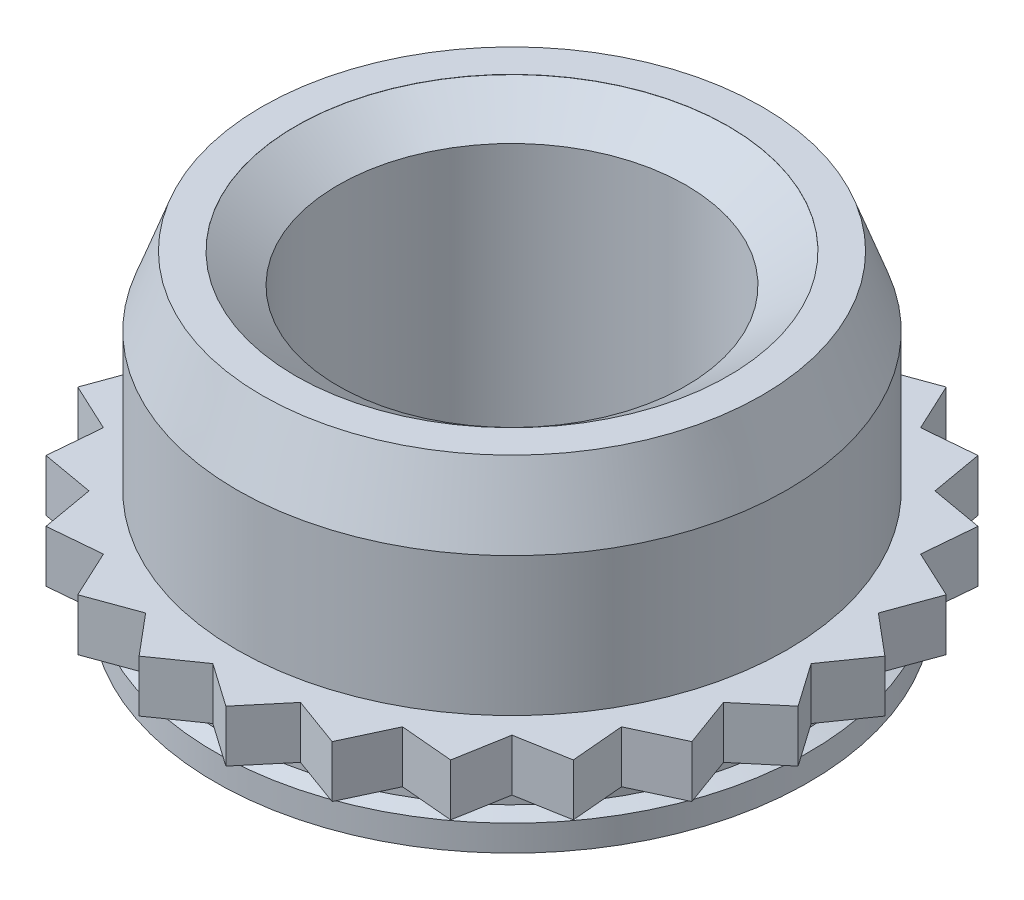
ISO-10303-21;
HEADER;
FILE_DESCRIPTION(('STEP AP214'),'2;1');
FILE_NAME('part.step','',(''),(''),'','','');
FILE_SCHEMA(('AUTOMOTIVE_DESIGN { 1 0 10303 214 1 1 1 1 }'));
ENDSEC;
DATA;
#1=APPLICATION_CONTEXT('core data for automotive mechanical design processes');
#2=APPLICATION_PROTOCOL_DEFINITION('international standard','automotive_design',2000,#1);
#3=PRODUCT_CONTEXT('',#1,'mechanical');
#4=PRODUCT('Part','Part','',(#3));
#5=PRODUCT_RELATED_PRODUCT_CATEGORY('part','',(#4));
#6=PRODUCT_DEFINITION_FORMATION('','',#4);
#7=PRODUCT_DEFINITION_CONTEXT('part definition',#1,'design');
#8=PRODUCT_DEFINITION('design','',#6,#7);
#9=PRODUCT_DEFINITION_SHAPE('','',#8);
#10=(LENGTH_UNIT() NAMED_UNIT(*) SI_UNIT(.MILLI.,.METRE.));
#11=(NAMED_UNIT(*) PLANE_ANGLE_UNIT() SI_UNIT($,.RADIAN.));
#12=(NAMED_UNIT(*) SI_UNIT($,.STERADIAN.) SOLID_ANGLE_UNIT());
#13=UNCERTAINTY_MEASURE_WITH_UNIT(LENGTH_MEASURE(1.E-05),#10,'distance_accuracy_value','');
#14=(GEOMETRIC_REPRESENTATION_CONTEXT(3) GLOBAL_UNCERTAINTY_ASSIGNED_CONTEXT((#13)) GLOBAL_UNIT_ASSIGNED_CONTEXT((#10,
#11,#12)) REPRESENTATION_CONTEXT('',''));
#15=CARTESIAN_POINT('',(0.,0.,0.));
#16=DIRECTION('',(0.,0.,1.));
#17=DIRECTION('',(1.,0.,0.));
#18=AXIS2_PLACEMENT_3D('',#15,#16,#17);
#19=CARTESIAN_POINT('',(0.,0.,0.));
#20=DIRECTION('',(0.,-1.,0.));
#21=DIRECTION('',(0.,0.,-1.));
#22=AXIS2_PLACEMENT_3D('',#19,#20,#21);
#23=CYLINDRICAL_SURFACE('',#22,4.0386);
#24=CARTESIAN_POINT('',(0.,2.032,0.));
#25=DIRECTION('',(0.,-1.,0.));
#26=DIRECTION('',(0.,0.,-1.));
#27=AXIS2_PLACEMENT_3D('',#24,#25,#26);
#28=CIRCLE('',#27,4.0386);
#29=CARTESIAN_POINT('',(0.,2.032,-4.0386));
#30=VERTEX_POINT('',#29);
#31=EDGE_CURVE('E11',#30,#30,#28,.T.);
#32=ORIENTED_EDGE('',*,*,#31,.T.);
#33=EDGE_LOOP('',(#32));
#34=FACE_BOUND('',#33,.T.);
#35=CARTESIAN_POINT('',(0.,0.,0.));
#36=DIRECTION('',(0.,-1.,0.));
#37=DIRECTION('',(0.,0.,-1.));
#38=AXIS2_PLACEMENT_3D('',#35,#36,#37);
#39=CIRCLE('',#38,4.0386);
#40=CARTESIAN_POINT('',(0.,0.,-4.0386));
#41=VERTEX_POINT('',#40);
#42=EDGE_CURVE('E742',#41,#41,#39,.T.);
#43=ORIENTED_EDGE('',*,*,#42,.F.);
#44=EDGE_LOOP('',(#43));
#45=FACE_BOUND('',#44,.T.);
#46=ADVANCED_FACE('F32',(#34,#45),#23,.T.);
#47=CARTESIAN_POINT('',(0.,2.032,0.));
#48=DIRECTION('',(0.,-1.,0.));
#49=DIRECTION('',(0.,0.,-1.));
#50=AXIS2_PLACEMENT_3D('',#47,#48,#49);
#51=CONICAL_SURFACE('',#50,4.0386,0.349065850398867);
#52=CARTESIAN_POINT('',(0.,3.048,0.));
#53=DIRECTION('',(0.,-1.,0.));
#54=DIRECTION('',(0.,0.,-1.));
#55=AXIS2_PLACEMENT_3D('',#52,#53,#54);
#56=CIRCLE('',#55,3.66880624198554);
#57=CARTESIAN_POINT('',(0.,3.048,-3.66880624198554));
#58=VERTEX_POINT('',#57);
#59=EDGE_CURVE('E40',#58,#58,#56,.T.);
#60=ORIENTED_EDGE('',*,*,#59,.T.);
#61=EDGE_LOOP('',(#60));
#62=FACE_BOUND('',#61,.T.);
#63=ORIENTED_EDGE('',*,*,#31,.F.);
#64=EDGE_LOOP('',(#63));
#65=FACE_BOUND('',#64,.T.);
#66=ADVANCED_FACE('F783',(#62,#65),#51,.T.);
#67=CARTESIAN_POINT('',(3.66880624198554,3.048,0.));
#68=DIRECTION('',(0.,1.,0.));
#69=DIRECTION('',(0.,0.,1.));
#70=AXIS2_PLACEMENT_3D('',#67,#68,#69);
#71=PLANE('',#70);
#72=CARTESIAN_POINT('',(0.,3.048,0.));
#73=DIRECTION('',(0.,1.,0.));
#74=DIRECTION('',(0.,0.,1.));
#75=AXIS2_PLACEMENT_3D('',#72,#73,#74);
#76=CIRCLE('',#75,3.17499999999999);
#77=CARTESIAN_POINT('',(0.,3.048,3.17499999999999));
#78=VERTEX_POINT('',#77);
#79=EDGE_CURVE('E35',#78,#78,#76,.T.);
#80=ORIENTED_EDGE('',*,*,#79,.F.);
#81=EDGE_LOOP('',(#80));
#82=FACE_BOUND('',#81,.T.);
#83=ORIENTED_EDGE('',*,*,#59,.F.);
#84=EDGE_LOOP('',(#83));
#85=FACE_BOUND('',#84,.T.);
#86=ADVANCED_FACE('F788',(#82,#85),#71,.T.);
#87=CARTESIAN_POINT('',(0.,0.,0.));
#88=DIRECTION('',(0.,-1.,0.));
#89=DIRECTION('',(0.,0.,-1.));
#90=AXIS2_PLACEMENT_3D('',#87,#88,#89);
#91=CYLINDRICAL_SURFACE('',#90,2.5527);
#92=CARTESIAN_POINT('',(0.,2.60988269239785,0.));
#93=DIRECTION('',(0.,-1.,0.));
#94=DIRECTION('',(0.,0.,-1.));
#95=AXIS2_PLACEMENT_3D('',#92,#93,#94);
#96=CIRCLE('',#95,2.5527);
#97=CARTESIAN_POINT('',(0.,2.60988269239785,-2.5527));
#98=VERTEX_POINT('',#97);
#99=EDGE_CURVE('E725',#98,#98,#96,.T.);
#100=ORIENTED_EDGE('',*,*,#99,.F.);
#101=EDGE_LOOP('',(#100));
#102=FACE_BOUND('',#101,.T.);
#103=CARTESIAN_POINT('',(0.,-1.08588269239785,0.));
#104=DIRECTION('',(0.,-1.,0.));
#105=DIRECTION('',(0.,0.,-1.));
#106=AXIS2_PLACEMENT_3D('',#103,#104,#105);
#107=CIRCLE('',#106,2.5527);
#108=CARTESIAN_POINT('',(0.,-1.08588269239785,-2.5527));
#109=VERTEX_POINT('',#108);
#110=EDGE_CURVE('E738',#109,#109,#107,.T.);
#111=ORIENTED_EDGE('',*,*,#110,.T.);
#112=EDGE_LOOP('',(#111));
#113=FACE_BOUND('',#112,.T.);
#114=ADVANCED_FACE('F768',(#102,#113),#91,.F.);
#115=CARTESIAN_POINT('',(2.5527,-1.524,0.));
#116=DIRECTION('',(0.,-1.,0.));
#117=DIRECTION('',(0.,0.,-1.));
#118=AXIS2_PLACEMENT_3D('',#115,#116,#117);
#119=PLANE('',#118);
#120=CARTESIAN_POINT('',(0.,-1.524,0.));
#121=DIRECTION('',(0.,-1.,0.));
#122=DIRECTION('',(0.,0.,-1.));
#123=AXIS2_PLACEMENT_3D('',#120,#121,#122);
#124=CIRCLE('',#123,3.175);
#125=CARTESIAN_POINT('',(0.,-1.524,-3.175));
#126=VERTEX_POINT('',#125);
#127=EDGE_CURVE('E741',#126,#126,#124,.T.);
#128=ORIENTED_EDGE('',*,*,#127,.F.);
#129=EDGE_LOOP('',(#128));
#130=FACE_BOUND('',#129,.T.);
#131=CARTESIAN_POINT('',(0.,-1.524,0.));
#132=DIRECTION('',(0.,-1.,0.));
#133=DIRECTION('',(0.,0.,-1.));
#134=AXIS2_PLACEMENT_3D('',#131,#132,#133);
#135=CIRCLE('',#134,4.3561);
#136=CARTESIAN_POINT('',(0.,-1.524,-4.3561));
#137=VERTEX_POINT('',#136);
#138=EDGE_CURVE('E754',#137,#137,#135,.T.);
#139=ORIENTED_EDGE('',*,*,#138,.T.);
#140=EDGE_LOOP('',(#139));
#141=FACE_BOUND('',#140,.T.);
#142=ADVANCED_FACE('F764',(#130,#141),#119,.T.);
#143=CARTESIAN_POINT('',(0.,0.,0.));
#144=DIRECTION('',(0.,-1.,0.));
#145=DIRECTION('',(0.,0.,-1.));
#146=AXIS2_PLACEMENT_3D('',#143,#144,#145);
#147=CYLINDRICAL_SURFACE('',#146,4.3561);
#148=CARTESIAN_POINT('',(0.,-1.143,0.));
#149=DIRECTION('',(0.,-1.,0.));
#150=DIRECTION('',(0.,0.,-1.));
#151=AXIS2_PLACEMENT_3D('',#148,#149,#150);
#152=CIRCLE('',#151,4.3561);
#153=CARTESIAN_POINT('',(0.,-1.143,-4.3561));
#154=VERTEX_POINT('',#153);
#155=EDGE_CURVE('E751',#154,#154,#152,.T.);
#156=ORIENTED_EDGE('',*,*,#155,.T.);
#157=EDGE_LOOP('',(#156));
#158=FACE_BOUND('',#157,.T.);
#159=ORIENTED_EDGE('',*,*,#138,.F.);
#160=EDGE_LOOP('',(#159));
#161=FACE_BOUND('',#160,.T.);
#162=ADVANCED_FACE('F767',(#158,#161),#147,.T.);
#163=CARTESIAN_POINT('',(0.,-1.143,0.));
#164=DIRECTION('',(0.,-1.,0.));
#165=DIRECTION('',(0.,0.,-1.));
#166=AXIS2_PLACEMENT_3D('',#163,#164,#165);
#167=CONICAL_SURFACE('',#166,4.3561,1.22173047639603);
#168=CARTESIAN_POINT('',(0.,-1.06372546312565,0.));
#169=DIRECTION('',(0.,-1.,0.));
#170=DIRECTION('',(0.,0.,-1.));
#171=AXIS2_PLACEMENT_3D('',#168,#169,#170);
#172=CIRCLE('',#171,4.138295);
#173=CARTESIAN_POINT('',(0.,-1.06372546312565,-4.138295));
#174=VERTEX_POINT('',#173);
#175=EDGE_CURVE('E748',#174,#174,#172,.T.);
#176=ORIENTED_EDGE('',*,*,#175,.T.);
#177=EDGE_LOOP('',(#176));
#178=FACE_BOUND('',#177,.T.);
#179=ORIENTED_EDGE('',*,*,#155,.F.);
#180=EDGE_LOOP('',(#179));
#181=FACE_BOUND('',#180,.T.);
#182=ADVANCED_FACE('F773',(#178,#181),#167,.T.);
#183=CARTESIAN_POINT('',(0.,0.,0.));
#184=DIRECTION('',(0.,-1.,0.));
#185=DIRECTION('',(0.,0.,-1.));
#186=AXIS2_PLACEMENT_3D('',#183,#184,#185);
#187=CYLINDRICAL_SURFACE('',#186,4.138295);
#188=CARTESIAN_POINT('',(0.,-0.762,0.));
#189=DIRECTION('',(0.,-1.,0.));
#190=DIRECTION('',(0.,0.,-1.));
#191=AXIS2_PLACEMENT_3D('',#188,#189,#190);
#192=CIRCLE('',#191,4.138295);
#193=CARTESIAN_POINT('',(0.,-0.762,-4.138295));
#194=VERTEX_POINT('',#193);
#195=EDGE_CURVE('E745',#194,#194,#192,.T.);
#196=ORIENTED_EDGE('',*,*,#195,.T.);
#197=EDGE_LOOP('',(#196));
#198=FACE_BOUND('',#197,.T.);
#199=ORIENTED_EDGE('',*,*,#175,.F.);
#200=EDGE_LOOP('',(#199));
#201=FACE_BOUND('',#200,.T.);
#202=ADVANCED_FACE('F779',(#198,#201),#187,.T.);
#203=CARTESIAN_POINT('',(4.138295,-0.762,0.));
#204=DIRECTION('',(0.,-1.,0.));
#205=DIRECTION('',(0.,0.,-1.));
#206=AXIS2_PLACEMENT_3D('',#203,#204,#205);
#207=PLANE('',#206);
#208=DIRECTION('',(0.766207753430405,0.,-0.642592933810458));
#209=VECTOR('',#208,1.);
#210=CARTESIAN_POINT('',(4.8350782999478,-0.762,0.636550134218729));
#211=LINE('',#210,#209);
#212=CARTESIAN_POINT('',(4.23956436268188,-0.762,1.13598784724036));
#213=VERTEX_POINT('',#212);
#214=CARTESIAN_POINT('',(4.8350782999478,-0.762,0.636550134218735));
#215=VERTEX_POINT('',#214);
#216=EDGE_CURVE('E498',#213,#215,#211,.T.);
#217=ORIENTED_EDGE('',*,*,#216,.F.);
#218=DIRECTION('',(-0.342258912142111,0.,-0.939605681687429));
#219=VECTOR('',#218,1.);
#220=CARTESIAN_POINT('',(4.23956436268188,-0.762,1.13598784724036));
#221=LINE('',#220,#219);
#222=CARTESIAN_POINT('',(4.50557570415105,-0.762,1.86627056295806));
#223=VERTEX_POINT('',#222);
#224=EDGE_CURVE('E368',#223,#213,#221,.T.);
#225=ORIENTED_EDGE('',*,*,#224,.F.);
#226=DIRECTION('',(0.906415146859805,0.,-0.422387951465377));
#227=VECTOR('',#226,1.);
#228=CARTESIAN_POINT('',(4.50557570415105,-0.762,1.86627056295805));
#229=LINE('',#228,#227);
#230=CARTESIAN_POINT('',(3.80108942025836,-0.762,2.19455999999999));
#231=VERTEX_POINT('',#230);
#232=EDGE_CURVE('E685',#231,#223,#229,.T.);
#233=ORIENTED_EDGE('',*,*,#232,.F.);
#234=DIRECTION('',(-0.0874088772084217,0.,-0.996172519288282));
#235=VECTOR('',#234,1.);
#236=CARTESIAN_POINT('',(3.80108942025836,-0.762,2.19455999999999));
#237=LINE('',#236,#235);
#238=CARTESIAN_POINT('',(3.8690255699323,-0.762,2.96880773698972));
#239=VERTEX_POINT('',#238);
#240=EDGE_CURVE('E681',#239,#231,#237,.T.);
#241=ORIENTED_EDGE('',*,*,#240,.F.);
#242=DIRECTION('',(0.984851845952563,0.,-0.173397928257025));
#243=VECTOR('',#242,1.);
#244=CARTESIAN_POINT('',(3.8690255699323,-0.762,2.96880773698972));
#245=LINE('',#244,#243);
#246=CARTESIAN_POINT('',(3.1035765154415,-0.762,3.10357651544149));
#247=VERTEX_POINT('',#246);
#248=EDGE_CURVE('E513',#247,#239,#245,.T.);
#249=ORIENTED_EDGE('',*,*,#248,.F.);
#250=DIRECTION('',(0.173397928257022,0.,-0.984851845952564));
#251=VECTOR('',#250,1.);
#252=CARTESIAN_POINT('',(3.1035765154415,-0.762,3.10357651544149));
#253=LINE('',#252,#251);
#254=CARTESIAN_POINT('',(2.96880773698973,-0.762,3.86902556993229));
#255=VERTEX_POINT('',#254);
#256=EDGE_CURVE('E507',#255,#247,#253,.T.);
#257=ORIENTED_EDGE('',*,*,#256,.F.);
#258=DIRECTION('',(0.996172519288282,0.,0.0874088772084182));
#259=VECTOR('',#258,1.);
#260=CARTESIAN_POINT('',(2.96880773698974,-0.762,3.86902556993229));
#261=LINE('',#260,#259);
#262=CARTESIAN_POINT('',(2.19456,-0.762,3.80108942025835));
#263=VERTEX_POINT('',#262);
#264=EDGE_CURVE('E531',#263,#255,#261,.T.);
#265=ORIENTED_EDGE('',*,*,#264,.F.);
#266=DIRECTION('',(0.422387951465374,0.,-0.906415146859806));
#267=VECTOR('',#266,1.);
#268=CARTESIAN_POINT('',(2.19456,-0.762,3.80108942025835));
#269=LINE('',#268,#267);
#270=CARTESIAN_POINT('',(1.86627056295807,-0.762,4.50557570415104));
#271=VERTEX_POINT('',#270);
#272=EDGE_CURVE('E527',#271,#263,#269,.T.);
#273=ORIENTED_EDGE('',*,*,#272,.F.);
#274=DIRECTION('',(0.939605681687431,0.,0.342258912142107));
#275=VECTOR('',#274,1.);
#276=CARTESIAN_POINT('',(1.86627056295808,-0.762,4.50557570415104));
#277=LINE('',#276,#275);
#278=CARTESIAN_POINT('',(1.13598784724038,-0.762,4.23956436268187));
#279=VERTEX_POINT('',#278);
#280=EDGE_CURVE('E699',#279,#271,#277,.T.);
#281=ORIENTED_EDGE('',*,*,#280,.F.);
#282=DIRECTION('',(0.642592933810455,0.,-0.766207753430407));
#283=VECTOR('',#282,1.);
#284=CARTESIAN_POINT('',(1.13598784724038,-0.762,4.23956436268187));
#285=LINE('',#284,#283);
#286=CARTESIAN_POINT('',(0.636550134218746,-0.762,4.8350782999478));
#287=VERTEX_POINT('',#286);
#288=EDGE_CURVE('E688',#287,#279,#285,.T.);
#289=ORIENTED_EDGE('',*,*,#288,.F.);
#290=DIRECTION('',(0.819006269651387,0.,0.573784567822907));
#291=VECTOR('',#290,1.);
#292=CARTESIAN_POINT('',(0.636550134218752,-0.762,4.8350782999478));
#293=LINE('',#292,#291);
#294=CARTESIAN_POINT('',(0.,-0.762,4.38912));
#295=VERTEX_POINT('',#294);
#296=EDGE_CURVE('E715',#295,#287,#293,.T.);
#297=ORIENTED_EDGE('',*,*,#296,.F.);
#298=DIRECTION('',(0.819006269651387,0.,-0.573784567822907));
#299=VECTOR('',#298,1.);
#300=CARTESIAN_POINT('',(0.,-0.762,4.38912));
#301=LINE('',#300,#299);
#302=CARTESIAN_POINT('',(-0.636550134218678,-0.762,4.83507829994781));
#303=VERTEX_POINT('',#302);
#304=EDGE_CURVE('E709',#303,#295,#301,.T.);
#305=ORIENTED_EDGE('',*,*,#304,.F.);
#306=DIRECTION('',(0.642592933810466,0.,0.766207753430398));
#307=VECTOR('',#306,1.);
#308=CARTESIAN_POINT('',(-0.636550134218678,-0.762,4.83507829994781));
#309=LINE('',#308,#307);
#310=CARTESIAN_POINT('',(-1.13598784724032,-0.762,4.23956436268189));
#311=VERTEX_POINT('',#310);
#312=EDGE_CURVE('E486',#311,#303,#309,.T.);
#313=ORIENTED_EDGE('',*,*,#312,.F.);
#314=DIRECTION('',(0.939605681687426,0.,-0.34225891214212));
#315=VECTOR('',#314,1.);
#316=CARTESIAN_POINT('',(-1.13598784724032,-0.762,4.23956436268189));
#317=LINE('',#316,#315);
#318=CARTESIAN_POINT('',(-1.86627056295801,-0.762,4.50557570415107));
#319=VERTEX_POINT('',#318);
#320=EDGE_CURVE('E489',#319,#311,#317,.T.);
#321=ORIENTED_EDGE('',*,*,#320,.F.);
#322=DIRECTION('',(0.422387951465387,0.,0.906415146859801));
#323=VECTOR('',#322,1.);
#324=CARTESIAN_POINT('',(-1.86627056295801,-0.762,4.50557570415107));
#325=LINE('',#324,#323);
#326=CARTESIAN_POINT('',(-2.19455999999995,-0.762,3.80108942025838));
#327=VERTEX_POINT('',#326);
#328=EDGE_CURVE('E669',#327,#319,#325,.T.);
#329=ORIENTED_EDGE('',*,*,#328,.F.);
#330=DIRECTION('',(0.996172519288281,0.,-0.0874088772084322));
#331=VECTOR('',#330,1.);
#332=CARTESIAN_POINT('',(-2.19455999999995,-0.762,3.80108942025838));
#333=LINE('',#332,#331);
#334=CARTESIAN_POINT('',(-2.96880773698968,-0.762,3.86902556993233));
#335=VERTEX_POINT('',#334);
#336=EDGE_CURVE('E665',#335,#327,#333,.T.);
#337=ORIENTED_EDGE('',*,*,#336,.F.);
#338=DIRECTION('',(0.173397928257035,0.,0.984851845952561));
#339=VECTOR('',#338,1.);
#340=CARTESIAN_POINT('',(-2.96880773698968,-0.762,3.86902556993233));
#341=LINE('',#340,#339);
#342=CARTESIAN_POINT('',(-3.10357651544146,-0.762,3.10357651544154));
#343=VERTEX_POINT('',#342);
#344=EDGE_CURVE('E470',#343,#335,#341,.T.);
#345=ORIENTED_EDGE('',*,*,#344,.F.);
#346=DIRECTION('',(0.984851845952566,0.,0.173397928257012));
#347=VECTOR('',#346,1.);
#348=CARTESIAN_POINT('',(-3.10357651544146,-0.762,3.10357651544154));
#349=LINE('',#348,#347);
#350=CARTESIAN_POINT('',(-3.86902556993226,-0.762,2.96880773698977));
#351=VERTEX_POINT('',#350);
#352=EDGE_CURVE('E474',#351,#343,#349,.T.);
#353=ORIENTED_EDGE('',*,*,#352,.F.);
#354=DIRECTION('',(-0.0874088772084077,0.,0.996172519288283));
#355=VECTOR('',#354,1.);
#356=CARTESIAN_POINT('',(-3.86902556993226,-0.762,2.96880773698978));
#357=LINE('',#356,#355);
#358=CARTESIAN_POINT('',(-3.80108942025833,-0.762,2.19456000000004));
#359=VERTEX_POINT('',#358);
#360=EDGE_CURVE('E653',#359,#351,#357,.T.);
#361=ORIENTED_EDGE('',*,*,#360,.F.);
#362=DIRECTION('',(0.906415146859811,0.,0.422387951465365));
#363=VECTOR('',#362,1.);
#364=CARTESIAN_POINT('',(-3.80108942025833,-0.762,2.19456000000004));
#365=LINE('',#364,#363);
#366=CARTESIAN_POINT('',(-4.50557570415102,-0.762,1.86627056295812));
#367=VERTEX_POINT('',#366);
#368=EDGE_CURVE('E649',#367,#359,#365,.T.);
#369=ORIENTED_EDGE('',*,*,#368,.F.);
#370=DIRECTION('',(-0.342258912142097,0.,0.939605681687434));
#371=VECTOR('',#370,1.);
#372=CARTESIAN_POINT('',(-4.50557570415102,-0.762,1.86627056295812));
#373=LINE('',#372,#371);
#374=CARTESIAN_POINT('',(-4.23956436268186,-0.762,1.13598784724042));
#375=VERTEX_POINT('',#374);
#376=EDGE_CURVE('E454',#375,#367,#373,.T.);
#377=ORIENTED_EDGE('',*,*,#376,.F.);
#378=DIRECTION('',(0.766207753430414,0.,0.642592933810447));
#379=VECTOR('',#378,1.);
#380=CARTESIAN_POINT('',(-4.23956436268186,-0.762,1.13598784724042));
#381=LINE('',#380,#379);
#382=CARTESIAN_POINT('',(-4.83507829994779,-0.762,0.636550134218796));
#383=VERTEX_POINT('',#382);
#384=EDGE_CURVE('E458',#383,#375,#381,.T.);
#385=ORIENTED_EDGE('',*,*,#384,.F.);
#386=DIRECTION('',(-0.573784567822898,0.,0.819006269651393));
#387=VECTOR('',#386,1.);
#388=CARTESIAN_POINT('',(-4.83507829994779,-0.762,0.636550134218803));
#389=LINE('',#388,#387);
#390=CARTESIAN_POINT('',(-4.38912,-0.762,0.));
#391=VERTEX_POINT('',#390);
#392=EDGE_CURVE('E637',#391,#383,#389,.T.);
#393=ORIENTED_EDGE('',*,*,#392,.F.);
#394=DIRECTION('',(0.573784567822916,0.,0.819006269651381));
#395=VECTOR('',#394,1.);
#396=CARTESIAN_POINT('',(-4.38912,-0.762,0.));
#397=LINE('',#396,#395);
#398=CARTESIAN_POINT('',(-4.83507829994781,-0.762,-0.636550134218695));
#399=VERTEX_POINT('',#398);
#400=EDGE_CURVE('E633',#399,#391,#397,.T.);
#401=ORIENTED_EDGE('',*,*,#400,.F.);
#402=DIRECTION('',(-0.7662077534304,0.,0.642592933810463));
#403=VECTOR('',#402,1.);
#404=CARTESIAN_POINT('',(-4.83507829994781,-0.762,-0.636550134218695));
#405=LINE('',#404,#403);
#406=CARTESIAN_POINT('',(-4.23956436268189,-0.762,-1.13598784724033));
#407=VERTEX_POINT('',#406);
#408=EDGE_CURVE('E438',#407,#399,#405,.T.);
#409=ORIENTED_EDGE('',*,*,#408,.F.);
#410=DIRECTION('',(0.342258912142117,0.,0.939605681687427));
#411=VECTOR('',#410,1.);
#412=CARTESIAN_POINT('',(-4.23956436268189,-0.762,-1.13598784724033));
#413=LINE('',#412,#411);
#414=CARTESIAN_POINT('',(-4.50557570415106,-0.762,-1.86627056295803));
#415=VERTEX_POINT('',#414);
#416=EDGE_CURVE('E442',#415,#407,#413,.T.);
#417=ORIENTED_EDGE('',*,*,#416,.F.);
#418=DIRECTION('',(-0.906415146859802,0.,0.422387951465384));
#419=VECTOR('',#418,1.);
#420=CARTESIAN_POINT('',(-4.50557570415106,-0.762,-1.86627056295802));
#421=LINE('',#420,#419);
#422=CARTESIAN_POINT('',(-3.80108942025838,-0.762,-2.19455999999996));
#423=VERTEX_POINT('',#422);
#424=EDGE_CURVE('E621',#423,#415,#421,.T.);
#425=ORIENTED_EDGE('',*,*,#424,.F.);
#426=DIRECTION('',(0.0874088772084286,0.,0.996172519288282));
#427=VECTOR('',#426,1.);
#428=CARTESIAN_POINT('',(-3.80108942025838,-0.762,-2.19455999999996));
#429=LINE('',#428,#427);
#430=CARTESIAN_POINT('',(-3.86902556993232,-0.762,-2.96880773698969));
#431=VERTEX_POINT('',#430);
#432=EDGE_CURVE('E617',#431,#423,#429,.T.);
#433=ORIENTED_EDGE('',*,*,#432,.F.);
#434=DIRECTION('',(-0.984851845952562,0.,0.173397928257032));
#435=VECTOR('',#434,1.);
#436=CARTESIAN_POINT('',(-3.86902556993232,-0.762,-2.96880773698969));
#437=LINE('',#436,#435);
#438=CARTESIAN_POINT('',(-3.10357651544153,-0.762,-3.10357651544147));
#439=VERTEX_POINT('',#438);
#440=EDGE_CURVE('E422',#439,#431,#437,.T.);
#441=ORIENTED_EDGE('',*,*,#440,.F.);
#442=DIRECTION('',(-0.173397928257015,0.,0.984851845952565));
#443=VECTOR('',#442,1.);
#444=CARTESIAN_POINT('',(-3.10357651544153,-0.762,-3.10357651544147));
#445=LINE('',#444,#443);
#446=CARTESIAN_POINT('',(-2.96880773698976,-0.762,-3.86902556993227));
#447=VERTEX_POINT('',#446);
#448=EDGE_CURVE('E426',#447,#439,#445,.T.);
#449=ORIENTED_EDGE('',*,*,#448,.F.);
#450=DIRECTION('',(-0.996172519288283,0.,-0.0874088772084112));
#451=VECTOR('',#450,1.);
#452=CARTESIAN_POINT('',(-2.96880773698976,-0.762,-3.86902556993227));
#453=LINE('',#452,#451);
#454=CARTESIAN_POINT('',(-2.19456000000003,-0.762,-3.80108942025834));
#455=VERTEX_POINT('',#454);
#456=EDGE_CURVE('E605',#455,#447,#453,.T.);
#457=ORIENTED_EDGE('',*,*,#456,.F.);
#458=DIRECTION('',(-0.422387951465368,0.,0.906415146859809));
#459=VECTOR('',#458,1.);
#460=CARTESIAN_POINT('',(-2.19456000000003,-0.762,-3.80108942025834));
#461=LINE('',#460,#459);
#462=CARTESIAN_POINT('',(-1.86627056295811,-0.762,-4.50557570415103));
#463=VERTEX_POINT('',#462);
#464=EDGE_CURVE('E601',#463,#455,#461,.T.);
#465=ORIENTED_EDGE('',*,*,#464,.F.);
#466=DIRECTION('',(-0.939605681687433,0.,-0.342258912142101));
#467=VECTOR('',#466,1.);
#468=CARTESIAN_POINT('',(-1.86627056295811,-0.762,-4.50557570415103));
#469=LINE('',#468,#467);
#470=CARTESIAN_POINT('',(-1.13598784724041,-0.762,-4.23956436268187));
#471=VERTEX_POINT('',#470);
#472=EDGE_CURVE('E406',#471,#463,#469,.T.);
#473=ORIENTED_EDGE('',*,*,#472,.F.);
#474=DIRECTION('',(-0.64259293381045,0.,0.766207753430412));
#475=VECTOR('',#474,1.);
#476=CARTESIAN_POINT('',(-1.13598784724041,-0.762,-4.23956436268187));
#477=LINE('',#476,#475);
#478=CARTESIAN_POINT('',(-0.636550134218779,-0.762,-4.83507829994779));
#479=VERTEX_POINT('',#478);
#480=EDGE_CURVE('E410',#479,#471,#477,.T.);
#481=ORIENTED_EDGE('',*,*,#480,.F.);
#482=DIRECTION('',(-0.819006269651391,0.,-0.573784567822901));
#483=VECTOR('',#482,1.);
#484=CARTESIAN_POINT('',(-0.636550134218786,-0.762,-4.83507829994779));
#485=LINE('',#484,#483);
#486=CARTESIAN_POINT('',(0.,-0.762,-4.38912));
#487=VERTEX_POINT('',#486);
#488=EDGE_CURVE('E589',#487,#479,#485,.T.);
#489=ORIENTED_EDGE('',*,*,#488,.F.);
#490=DIRECTION('',(-0.819006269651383,0.,0.573784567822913));
#491=VECTOR('',#490,1.);
#492=CARTESIAN_POINT('',(0.,-0.762,-4.38912));
#493=LINE('',#492,#491);
#494=CARTESIAN_POINT('',(0.636550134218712,-0.762,-4.8350782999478));
#495=VERTEX_POINT('',#494);
#496=EDGE_CURVE('E585',#495,#487,#493,.T.);
#497=ORIENTED_EDGE('',*,*,#496,.F.);
#498=DIRECTION('',(-0.642592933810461,0.,-0.766207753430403));
#499=VECTOR('',#498,1.);
#500=CARTESIAN_POINT('',(0.636550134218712,-0.762,-4.8350782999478));
#501=LINE('',#500,#499);
#502=CARTESIAN_POINT('',(1.13598784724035,-0.762,-4.23956436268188));
#503=VERTEX_POINT('',#502);
#504=EDGE_CURVE('E390',#503,#495,#501,.T.);
#505=ORIENTED_EDGE('',*,*,#504,.F.);
#506=DIRECTION('',(-0.939605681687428,0.,0.342258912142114));
#507=VECTOR('',#506,1.);
#508=CARTESIAN_POINT('',(1.13598784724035,-0.762,-4.23956436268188));
#509=LINE('',#508,#507);
#510=CARTESIAN_POINT('',(1.86627056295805,-0.762,-4.50557570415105));
#511=VERTEX_POINT('',#510);
#512=EDGE_CURVE('E394',#511,#503,#509,.T.);
#513=ORIENTED_EDGE('',*,*,#512,.F.);
#514=DIRECTION('',(-0.422387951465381,0.,-0.906415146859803));
#515=VECTOR('',#514,1.);
#516=CARTESIAN_POINT('',(1.86627056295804,-0.762,-4.50557570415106));
#517=LINE('',#516,#515);
#518=CARTESIAN_POINT('',(2.19455999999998,-0.762,-3.80108942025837));
#519=VERTEX_POINT('',#518);
#520=EDGE_CURVE('E573',#519,#511,#517,.T.);
#521=ORIENTED_EDGE('',*,*,#520,.F.);
#522=DIRECTION('',(-0.996172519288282,0.,0.0874088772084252));
#523=VECTOR('',#522,1.);
#524=CARTESIAN_POINT('',(2.19455999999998,-0.762,-3.80108942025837));
#525=LINE('',#524,#523);
#526=CARTESIAN_POINT('',(2.9688077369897,-0.762,-3.86902556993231));
#527=VERTEX_POINT('',#526);
#528=EDGE_CURVE('E569',#527,#519,#525,.T.);
#529=ORIENTED_EDGE('',*,*,#528,.F.);
#530=DIRECTION('',(-0.173397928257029,0.,-0.984851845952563));
#531=VECTOR('',#530,1.);
#532=CARTESIAN_POINT('',(2.9688077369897,-0.762,-3.86902556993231));
#533=LINE('',#532,#531);
#534=CARTESIAN_POINT('',(3.10357651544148,-0.762,-3.10357651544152));
#535=VERTEX_POINT('',#534);
#536=EDGE_CURVE('E374',#535,#527,#533,.T.);
#537=ORIENTED_EDGE('',*,*,#536,.F.);
#538=DIRECTION('',(-0.984851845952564,0.,-0.173397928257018));
#539=VECTOR('',#538,1.);
#540=CARTESIAN_POINT('',(3.10357651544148,-0.762,-3.10357651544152));
#541=LINE('',#540,#539);
#542=CARTESIAN_POINT('',(3.86902556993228,-0.762,-2.96880773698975));
#543=VERTEX_POINT('',#542);
#544=EDGE_CURVE('E378',#543,#535,#541,.T.);
#545=ORIENTED_EDGE('',*,*,#544,.F.);
#546=DIRECTION('',(0.0874088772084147,0.,-0.996172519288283));
#547=VECTOR('',#546,1.);
#548=CARTESIAN_POINT('',(3.86902556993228,-0.762,-2.96880773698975));
#549=LINE('',#548,#547);
#550=CARTESIAN_POINT('',(3.80108942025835,-0.762,-2.19456000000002));
#551=VERTEX_POINT('',#550);
#552=EDGE_CURVE('E559',#551,#543,#549,.T.);
#553=ORIENTED_EDGE('',*,*,#552,.F.);
#554=DIRECTION('',(-0.906415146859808,0.,-0.422387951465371));
#555=VECTOR('',#554,1.);
#556=CARTESIAN_POINT('',(3.80108942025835,-0.762,-2.19456000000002));
#557=LINE('',#556,#555);
#558=CARTESIAN_POINT('',(4.50557570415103,-0.762,-1.86627056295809));
#559=VERTEX_POINT('',#558);
#560=EDGE_CURVE('E555',#559,#551,#557,.T.);
#561=ORIENTED_EDGE('',*,*,#560,.F.);
#562=DIRECTION('',(0.342258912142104,0.,-0.939605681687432));
#563=VECTOR('',#562,1.);
#564=CARTESIAN_POINT('',(4.50557570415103,-0.762,-1.86627056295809));
#565=LINE('',#564,#563);
#566=CARTESIAN_POINT('',(4.23956436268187,-0.762,-1.13598784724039));
#567=VERTEX_POINT('',#566);
#568=EDGE_CURVE('E362',#567,#559,#565,.T.);
#569=ORIENTED_EDGE('',*,*,#568,.F.);
#570=DIRECTION('',(-0.76620775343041,0.,-0.642592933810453));
#571=VECTOR('',#570,1.);
#572=CARTESIAN_POINT('',(4.23956436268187,-0.762,-1.13598784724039));
#573=LINE('',#572,#571);
#574=CARTESIAN_POINT('',(4.8350782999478,-0.762,-0.636550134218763));
#575=VERTEX_POINT('',#574);
#576=EDGE_CURVE('E345',#575,#567,#573,.T.);
#577=ORIENTED_EDGE('',*,*,#576,.F.);
#578=DIRECTION('',(0.573784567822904,0.,-0.819006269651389));
#579=VECTOR('',#578,1.);
#580=CARTESIAN_POINT('',(4.8350782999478,-0.762,-0.636550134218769));
#581=LINE('',#580,#579);
#582=CARTESIAN_POINT('',(4.38912,-0.762,0.));
#583=VERTEX_POINT('',#582);
#584=EDGE_CURVE('E546',#583,#575,#581,.T.);
#585=ORIENTED_EDGE('',*,*,#584,.F.);
#586=DIRECTION('',(-0.57378456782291,0.,-0.819006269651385));
#587=VECTOR('',#586,1.);
#588=CARTESIAN_POINT('',(4.38912,-0.762,0.));
#589=LINE('',#588,#587);
#590=EDGE_CURVE('E542',#215,#583,#589,.T.);
#591=ORIENTED_EDGE('',*,*,#590,.F.);
#592=EDGE_LOOP('',(#217,#225,#233,#241,#249,#257,#265,#273,#281,#289,#297,#305,#313,#321,#329,
#337,#345,#353,#361,#369,#377,#385,#393,#401,#409,#417,#425,#433,#441,#449,#457,#465,#473,#481,
#489,#497,#505,#513,#521,#529,#537,#545,#553,#561,#569,#577,#585,#591));
#593=FACE_BOUND('',#592,.T.);
#594=ORIENTED_EDGE('',*,*,#195,.F.);
#595=EDGE_LOOP('',(#594));
#596=FACE_BOUND('',#595,.T.);
#597=ADVANCED_FACE('F795',(#593,#596),#207,.T.);
#598=CARTESIAN_POINT('',(4.8768,0.,0.));
#599=DIRECTION('',(0.,1.,0.));
#600=DIRECTION('',(0.,0.,1.));
#601=AXIS2_PLACEMENT_3D('',#598,#599,#600);
#602=PLANE('',#601);
#603=DIRECTION('',(0.766207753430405,0.,-0.642592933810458));
#604=VECTOR('',#603,1.);
#605=CARTESIAN_POINT('',(4.8350782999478,0.,0.636550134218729));
#606=LINE('',#605,#604);
#607=CARTESIAN_POINT('',(4.23956436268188,0.,1.13598784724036));
#608=VERTEX_POINT('',#607);
#609=CARTESIAN_POINT('',(4.8350782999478,0.,0.636550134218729));
#610=VERTEX_POINT('',#609);
#611=EDGE_CURVE('E497',#608,#610,#606,.T.);
#612=ORIENTED_EDGE('',*,*,#611,.T.);
#613=DIRECTION('',(-0.57378456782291,0.,-0.819006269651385));
#614=VECTOR('',#613,1.);
#615=CARTESIAN_POINT('',(4.38912,0.,0.));
#616=LINE('',#615,#614);
#617=CARTESIAN_POINT('',(4.38912,0.,0.));
#618=VERTEX_POINT('',#617);
#619=EDGE_CURVE('E543',#610,#618,#616,.T.);
#620=ORIENTED_EDGE('',*,*,#619,.T.);
#621=DIRECTION('',(0.573784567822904,0.,-0.819006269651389));
#622=VECTOR('',#621,1.);
#623=CARTESIAN_POINT('',(4.8350782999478,0.,-0.636550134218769));
#624=LINE('',#623,#622);
#625=CARTESIAN_POINT('',(4.8350782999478,0.,-0.636550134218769));
#626=VERTEX_POINT('',#625);
#627=EDGE_CURVE('E48',#618,#626,#624,.T.);
#628=ORIENTED_EDGE('',*,*,#627,.T.);
#629=DIRECTION('',(-0.76620775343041,0.,-0.642592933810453));
#630=VECTOR('',#629,1.);
#631=CARTESIAN_POINT('',(4.23956436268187,0.,-1.13598784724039));
#632=LINE('',#631,#630);
#633=CARTESIAN_POINT('',(4.23956436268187,0.,-1.13598784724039));
#634=VERTEX_POINT('',#633);
#635=EDGE_CURVE('E343',#626,#634,#632,.T.);
#636=ORIENTED_EDGE('',*,*,#635,.T.);
#637=DIRECTION('',(0.342258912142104,0.,-0.939605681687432));
#638=VECTOR('',#637,1.);
#639=CARTESIAN_POINT('',(4.50557570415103,0.,-1.86627056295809));
#640=LINE('',#639,#638);
#641=CARTESIAN_POINT('',(4.50557570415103,0.,-1.86627056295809));
#642=VERTEX_POINT('',#641);
#643=EDGE_CURVE('E349',#634,#642,#640,.T.);
#644=ORIENTED_EDGE('',*,*,#643,.T.);
#645=DIRECTION('',(-0.906415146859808,0.,-0.422387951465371));
#646=VECTOR('',#645,1.);
#647=CARTESIAN_POINT('',(3.80108942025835,0.,-2.19456000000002));
#648=LINE('',#647,#646);
#649=CARTESIAN_POINT('',(3.80108942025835,0.,-2.19456000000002));
#650=VERTEX_POINT('',#649);
#651=EDGE_CURVE('E556',#642,#650,#648,.T.);
#652=ORIENTED_EDGE('',*,*,#651,.T.);
#653=DIRECTION('',(0.0874088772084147,0.,-0.996172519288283));
#654=VECTOR('',#653,1.);
#655=CARTESIAN_POINT('',(3.86902556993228,0.,-2.96880773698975));
#656=LINE('',#655,#654);
#657=CARTESIAN_POINT('',(3.86902556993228,0.,-2.96880773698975));
#658=VERTEX_POINT('',#657);
#659=EDGE_CURVE('E56',#650,#658,#656,.T.);
#660=ORIENTED_EDGE('',*,*,#659,.T.);
#661=DIRECTION('',(-0.984851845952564,0.,-0.173397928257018));
#662=VECTOR('',#661,1.);
#663=CARTESIAN_POINT('',(3.10357651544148,0.,-3.10357651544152));
#664=LINE('',#663,#662);
#665=CARTESIAN_POINT('',(3.10357651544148,0.,-3.10357651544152));
#666=VERTEX_POINT('',#665);
#667=EDGE_CURVE('E370',#658,#666,#664,.T.);
#668=ORIENTED_EDGE('',*,*,#667,.T.);
#669=DIRECTION('',(-0.173397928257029,0.,-0.984851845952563));
#670=VECTOR('',#669,1.);
#671=CARTESIAN_POINT('',(2.9688077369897,0.,-3.86902556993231));
#672=LINE('',#671,#670);
#673=CARTESIAN_POINT('',(2.9688077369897,0.,-3.86902556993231));
#674=VERTEX_POINT('',#673);
#675=EDGE_CURVE('E373',#666,#674,#672,.T.);
#676=ORIENTED_EDGE('',*,*,#675,.T.);
#677=DIRECTION('',(-0.996172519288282,0.,0.0874088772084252));
#678=VECTOR('',#677,1.);
#679=CARTESIAN_POINT('',(2.19455999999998,0.,-3.80108942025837));
#680=LINE('',#679,#678);
#681=CARTESIAN_POINT('',(2.19455999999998,0.,-3.80108942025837));
#682=VERTEX_POINT('',#681);
#683=EDGE_CURVE('E570',#674,#682,#680,.T.);
#684=ORIENTED_EDGE('',*,*,#683,.T.);
#685=DIRECTION('',(-0.422387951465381,0.,-0.906415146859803));
#686=VECTOR('',#685,1.);
#687=CARTESIAN_POINT('',(1.86627056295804,0.,-4.50557570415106));
#688=LINE('',#687,#686);
#689=CARTESIAN_POINT('',(1.86627056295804,0.,-4.50557570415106));
#690=VERTEX_POINT('',#689);
#691=EDGE_CURVE('E562',#682,#690,#688,.T.);
#692=ORIENTED_EDGE('',*,*,#691,.T.);
#693=DIRECTION('',(-0.939605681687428,0.,0.342258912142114));
#694=VECTOR('',#693,1.);
#695=CARTESIAN_POINT('',(1.13598784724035,0.,-4.23956436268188));
#696=LINE('',#695,#694);
#697=CARTESIAN_POINT('',(1.13598784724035,0.,-4.23956436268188));
#698=VERTEX_POINT('',#697);
#699=EDGE_CURVE('E386',#690,#698,#696,.T.);
#700=ORIENTED_EDGE('',*,*,#699,.T.);
#701=DIRECTION('',(-0.642592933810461,0.,-0.766207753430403));
#702=VECTOR('',#701,1.);
#703=CARTESIAN_POINT('',(0.636550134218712,0.,-4.8350782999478));
#704=LINE('',#703,#702);
#705=CARTESIAN_POINT('',(0.636550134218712,0.,-4.8350782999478));
#706=VERTEX_POINT('',#705);
#707=EDGE_CURVE('E389',#698,#706,#704,.T.);
#708=ORIENTED_EDGE('',*,*,#707,.T.);
#709=DIRECTION('',(-0.819006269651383,0.,0.573784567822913));
#710=VECTOR('',#709,1.);
#711=CARTESIAN_POINT('',(0.,0.,-4.38912));
#712=LINE('',#711,#710);
#713=CARTESIAN_POINT('',(0.,0.,-4.38912));
#714=VERTEX_POINT('',#713);
#715=EDGE_CURVE('E586',#706,#714,#712,.T.);
#716=ORIENTED_EDGE('',*,*,#715,.T.);
#717=DIRECTION('',(-0.819006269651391,0.,-0.573784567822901));
#718=VECTOR('',#717,1.);
#719=CARTESIAN_POINT('',(-0.636550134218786,0.,-4.83507829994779));
#720=LINE('',#719,#718);
#721=CARTESIAN_POINT('',(-0.636550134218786,0.,-4.83507829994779));
#722=VERTEX_POINT('',#721);
#723=EDGE_CURVE('E576',#714,#722,#720,.T.);
#724=ORIENTED_EDGE('',*,*,#723,.T.);
#725=DIRECTION('',(-0.64259293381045,0.,0.766207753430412));
#726=VECTOR('',#725,1.);
#727=CARTESIAN_POINT('',(-1.13598784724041,0.,-4.23956436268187));
#728=LINE('',#727,#726);
#729=CARTESIAN_POINT('',(-1.13598784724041,0.,-4.23956436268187));
#730=VERTEX_POINT('',#729);
#731=EDGE_CURVE('E402',#722,#730,#728,.T.);
#732=ORIENTED_EDGE('',*,*,#731,.T.);
#733=DIRECTION('',(-0.939605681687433,0.,-0.342258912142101));
#734=VECTOR('',#733,1.);
#735=CARTESIAN_POINT('',(-1.86627056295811,0.,-4.50557570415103));
#736=LINE('',#735,#734);
#737=CARTESIAN_POINT('',(-1.86627056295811,0.,-4.50557570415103));
#738=VERTEX_POINT('',#737);
#739=EDGE_CURVE('E405',#730,#738,#736,.T.);
#740=ORIENTED_EDGE('',*,*,#739,.T.);
#741=DIRECTION('',(-0.422387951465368,0.,0.906415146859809));
#742=VECTOR('',#741,1.);
#743=CARTESIAN_POINT('',(-2.19456000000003,0.,-3.80108942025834));
#744=LINE('',#743,#742);
#745=CARTESIAN_POINT('',(-2.19456000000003,0.,-3.80108942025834));
#746=VERTEX_POINT('',#745);
#747=EDGE_CURVE('E602',#738,#746,#744,.T.);
#748=ORIENTED_EDGE('',*,*,#747,.T.);
#749=DIRECTION('',(-0.996172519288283,0.,-0.0874088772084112));
#750=VECTOR('',#749,1.);
#751=CARTESIAN_POINT('',(-2.96880773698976,0.,-3.86902556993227));
#752=LINE('',#751,#750);
#753=CARTESIAN_POINT('',(-2.96880773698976,0.,-3.86902556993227));
#754=VERTEX_POINT('',#753);
#755=EDGE_CURVE('E592',#746,#754,#752,.T.);
#756=ORIENTED_EDGE('',*,*,#755,.T.);
#757=DIRECTION('',(-0.173397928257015,0.,0.984851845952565));
#758=VECTOR('',#757,1.);
#759=CARTESIAN_POINT('',(-3.10357651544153,0.,-3.10357651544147));
#760=LINE('',#759,#758);
#761=CARTESIAN_POINT('',(-3.10357651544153,0.,-3.10357651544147));
#762=VERTEX_POINT('',#761);
#763=EDGE_CURVE('E418',#754,#762,#760,.T.);
#764=ORIENTED_EDGE('',*,*,#763,.T.);
#765=DIRECTION('',(-0.984851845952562,0.,0.173397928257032));
#766=VECTOR('',#765,1.);
#767=CARTESIAN_POINT('',(-3.86902556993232,0.,-2.96880773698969));
#768=LINE('',#767,#766);
#769=CARTESIAN_POINT('',(-3.86902556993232,0.,-2.96880773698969));
#770=VERTEX_POINT('',#769);
#771=EDGE_CURVE('E421',#762,#770,#768,.T.);
#772=ORIENTED_EDGE('',*,*,#771,.T.);
#773=DIRECTION('',(0.0874088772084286,0.,0.996172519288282));
#774=VECTOR('',#773,1.);
#775=CARTESIAN_POINT('',(-3.80108942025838,0.,-2.19455999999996));
#776=LINE('',#775,#774);
#777=CARTESIAN_POINT('',(-3.80108942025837,0.,-2.19455999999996));
#778=VERTEX_POINT('',#777);
#779=EDGE_CURVE('E618',#770,#778,#776,.T.);
#780=ORIENTED_EDGE('',*,*,#779,.T.);
#781=DIRECTION('',(-0.906415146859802,0.,0.422387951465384));
#782=VECTOR('',#781,1.);
#783=CARTESIAN_POINT('',(-4.50557570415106,0.,-1.86627056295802));
#784=LINE('',#783,#782);
#785=CARTESIAN_POINT('',(-4.50557570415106,0.,-1.86627056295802));
#786=VERTEX_POINT('',#785);
#787=EDGE_CURVE('E608',#778,#786,#784,.T.);
#788=ORIENTED_EDGE('',*,*,#787,.T.);
#789=DIRECTION('',(0.342258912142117,0.,0.939605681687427));
#790=VECTOR('',#789,1.);
#791=CARTESIAN_POINT('',(-4.23956436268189,0.,-1.13598784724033));
#792=LINE('',#791,#790);
#793=CARTESIAN_POINT('',(-4.23956436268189,0.,-1.13598784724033));
#794=VERTEX_POINT('',#793);
#795=EDGE_CURVE('E434',#786,#794,#792,.T.);
#796=ORIENTED_EDGE('',*,*,#795,.T.);
#797=DIRECTION('',(-0.7662077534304,0.,0.642592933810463));
#798=VECTOR('',#797,1.);
#799=CARTESIAN_POINT('',(-4.83507829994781,0.,-0.636550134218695));
#800=LINE('',#799,#798);
#801=CARTESIAN_POINT('',(-4.83507829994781,0.,-0.636550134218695));
#802=VERTEX_POINT('',#801);
#803=EDGE_CURVE('E437',#794,#802,#800,.T.);
#804=ORIENTED_EDGE('',*,*,#803,.T.);
#805=DIRECTION('',(0.573784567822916,0.,0.819006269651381));
#806=VECTOR('',#805,1.);
#807=CARTESIAN_POINT('',(-4.38912,0.,0.));
#808=LINE('',#807,#806);
#809=CARTESIAN_POINT('',(-4.38912,0.,0.));
#810=VERTEX_POINT('',#809);
#811=EDGE_CURVE('E634',#802,#810,#808,.T.);
#812=ORIENTED_EDGE('',*,*,#811,.T.);
#813=DIRECTION('',(-0.573784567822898,0.,0.819006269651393));
#814=VECTOR('',#813,1.);
#815=CARTESIAN_POINT('',(-4.83507829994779,0.,0.636550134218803));
#816=LINE('',#815,#814);
#817=CARTESIAN_POINT('',(-4.83507829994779,0.,0.636550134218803));
#818=VERTEX_POINT('',#817);
#819=EDGE_CURVE('E624',#810,#818,#816,.T.);
#820=ORIENTED_EDGE('',*,*,#819,.T.);
#821=DIRECTION('',(0.766207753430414,0.,0.642592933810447));
#822=VECTOR('',#821,1.);
#823=CARTESIAN_POINT('',(-4.23956436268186,0.,1.13598784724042));
#824=LINE('',#823,#822);
#825=CARTESIAN_POINT('',(-4.23956436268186,0.,1.13598784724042));
#826=VERTEX_POINT('',#825);
#827=EDGE_CURVE('E450',#818,#826,#824,.T.);
#828=ORIENTED_EDGE('',*,*,#827,.T.);
#829=DIRECTION('',(-0.342258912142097,0.,0.939605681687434));
#830=VECTOR('',#829,1.);
#831=CARTESIAN_POINT('',(-4.50557570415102,0.,1.86627056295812));
#832=LINE('',#831,#830);
#833=CARTESIAN_POINT('',(-4.50557570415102,0.,1.86627056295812));
#834=VERTEX_POINT('',#833);
#835=EDGE_CURVE('E453',#826,#834,#832,.T.);
#836=ORIENTED_EDGE('',*,*,#835,.T.);
#837=DIRECTION('',(0.906415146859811,0.,0.422387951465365));
#838=VECTOR('',#837,1.);
#839=CARTESIAN_POINT('',(-3.80108942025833,0.,2.19456000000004));
#840=LINE('',#839,#838);
#841=CARTESIAN_POINT('',(-3.80108942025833,0.,2.19456000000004));
#842=VERTEX_POINT('',#841);
#843=EDGE_CURVE('E650',#834,#842,#840,.T.);
#844=ORIENTED_EDGE('',*,*,#843,.T.);
#845=DIRECTION('',(-0.0874088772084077,0.,0.996172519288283));
#846=VECTOR('',#845,1.);
#847=CARTESIAN_POINT('',(-3.86902556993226,0.,2.96880773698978));
#848=LINE('',#847,#846);
#849=CARTESIAN_POINT('',(-3.86902556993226,0.,2.96880773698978));
#850=VERTEX_POINT('',#849);
#851=EDGE_CURVE('E640',#842,#850,#848,.T.);
#852=ORIENTED_EDGE('',*,*,#851,.T.);
#853=DIRECTION('',(0.984851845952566,0.,0.173397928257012));
#854=VECTOR('',#853,1.);
#855=CARTESIAN_POINT('',(-3.10357651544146,0.,3.10357651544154));
#856=LINE('',#855,#854);
#857=CARTESIAN_POINT('',(-3.10357651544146,0.,3.10357651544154));
#858=VERTEX_POINT('',#857);
#859=EDGE_CURVE('E466',#850,#858,#856,.T.);
#860=ORIENTED_EDGE('',*,*,#859,.T.);
#861=DIRECTION('',(0.173397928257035,0.,0.984851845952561));
#862=VECTOR('',#861,1.);
#863=CARTESIAN_POINT('',(-2.96880773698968,0.,3.86902556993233));
#864=LINE('',#863,#862);
#865=CARTESIAN_POINT('',(-2.96880773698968,0.,3.86902556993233));
#866=VERTEX_POINT('',#865);
#867=EDGE_CURVE('E469',#858,#866,#864,.T.);
#868=ORIENTED_EDGE('',*,*,#867,.T.);
#869=DIRECTION('',(0.996172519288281,0.,-0.0874088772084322));
#870=VECTOR('',#869,1.);
#871=CARTESIAN_POINT('',(-2.19455999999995,0.,3.80108942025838));
#872=LINE('',#871,#870);
#873=CARTESIAN_POINT('',(-2.19455999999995,0.,3.80108942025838));
#874=VERTEX_POINT('',#873);
#875=EDGE_CURVE('E666',#866,#874,#872,.T.);
#876=ORIENTED_EDGE('',*,*,#875,.T.);
#877=DIRECTION('',(0.422387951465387,0.,0.906415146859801));
#878=VECTOR('',#877,1.);
#879=CARTESIAN_POINT('',(-1.86627056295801,0.,4.50557570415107));
#880=LINE('',#879,#878);
#881=CARTESIAN_POINT('',(-1.86627056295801,0.,4.50557570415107));
#882=VERTEX_POINT('',#881);
#883=EDGE_CURVE('E656',#874,#882,#880,.T.);
#884=ORIENTED_EDGE('',*,*,#883,.T.);
#885=DIRECTION('',(0.939605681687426,0.,-0.34225891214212));
#886=VECTOR('',#885,1.);
#887=CARTESIAN_POINT('',(-1.13598784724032,0.,4.23956436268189));
#888=LINE('',#887,#886);
#889=CARTESIAN_POINT('',(-1.13598784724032,0.,4.23956436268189));
#890=VERTEX_POINT('',#889);
#891=EDGE_CURVE('E482',#882,#890,#888,.T.);
#892=ORIENTED_EDGE('',*,*,#891,.T.);
#893=DIRECTION('',(0.642592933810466,0.,0.766207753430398));
#894=VECTOR('',#893,1.);
#895=CARTESIAN_POINT('',(-0.636550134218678,0.,4.83507829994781));
#896=LINE('',#895,#894);
#897=CARTESIAN_POINT('',(-0.636550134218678,0.,4.83507829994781));
#898=VERTEX_POINT('',#897);
#899=EDGE_CURVE('E485',#890,#898,#896,.T.);
#900=ORIENTED_EDGE('',*,*,#899,.T.);
#901=DIRECTION('',(0.819006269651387,0.,-0.573784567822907));
#902=VECTOR('',#901,1.);
#903=CARTESIAN_POINT('',(0.,0.,4.38912));
#904=LINE('',#903,#902);
#905=CARTESIAN_POINT('',(0.,0.,4.38912));
#906=VERTEX_POINT('',#905);
#907=EDGE_CURVE('E711',#898,#906,#904,.T.);
#908=ORIENTED_EDGE('',*,*,#907,.T.);
#909=DIRECTION('',(0.819006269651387,0.,0.573784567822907));
#910=VECTOR('',#909,1.);
#911=CARTESIAN_POINT('',(0.636550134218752,0.,4.8350782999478));
#912=LINE('',#911,#910);
#913=CARTESIAN_POINT('',(0.636550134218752,0.,4.8350782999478));
#914=VERTEX_POINT('',#913);
#915=EDGE_CURVE('E714',#906,#914,#912,.T.);
#916=ORIENTED_EDGE('',*,*,#915,.T.);
#917=DIRECTION('',(0.642592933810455,0.,-0.766207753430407));
#918=VECTOR('',#917,1.);
#919=CARTESIAN_POINT('',(1.13598784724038,0.,4.23956436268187));
#920=LINE('',#919,#918);
#921=CARTESIAN_POINT('',(1.13598784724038,0.,4.23956436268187));
#922=VERTEX_POINT('',#921);
#923=EDGE_CURVE('E695',#914,#922,#920,.T.);
#924=ORIENTED_EDGE('',*,*,#923,.T.);
#925=DIRECTION('',(0.939605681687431,0.,0.342258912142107));
#926=VECTOR('',#925,1.);
#927=CARTESIAN_POINT('',(1.86627056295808,0.,4.50557570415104));
#928=LINE('',#927,#926);
#929=CARTESIAN_POINT('',(1.86627056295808,0.,4.50557570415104));
#930=VERTEX_POINT('',#929);
#931=EDGE_CURVE('E698',#922,#930,#928,.T.);
#932=ORIENTED_EDGE('',*,*,#931,.T.);
#933=DIRECTION('',(0.422387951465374,0.,-0.906415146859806));
#934=VECTOR('',#933,1.);
#935=CARTESIAN_POINT('',(2.19456,0.,3.80108942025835));
#936=LINE('',#935,#934);
#937=CARTESIAN_POINT('',(2.19456,0.,3.80108942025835));
#938=VERTEX_POINT('',#937);
#939=EDGE_CURVE('E528',#930,#938,#936,.T.);
#940=ORIENTED_EDGE('',*,*,#939,.T.);
#941=DIRECTION('',(0.996172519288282,0.,0.0874088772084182));
#942=VECTOR('',#941,1.);
#943=CARTESIAN_POINT('',(2.96880773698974,0.,3.86902556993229));
#944=LINE('',#943,#942);
#945=CARTESIAN_POINT('',(2.96880773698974,0.,3.86902556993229));
#946=VERTEX_POINT('',#945);
#947=EDGE_CURVE('E523',#938,#946,#944,.T.);
#948=ORIENTED_EDGE('',*,*,#947,.T.);
#949=DIRECTION('',(0.173397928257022,0.,-0.984851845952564));
#950=VECTOR('',#949,1.);
#951=CARTESIAN_POINT('',(3.1035765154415,0.,3.10357651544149));
#952=LINE('',#951,#950);
#953=CARTESIAN_POINT('',(3.1035765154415,0.,3.10357651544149));
#954=VERTEX_POINT('',#953);
#955=EDGE_CURVE('E509',#946,#954,#952,.T.);
#956=ORIENTED_EDGE('',*,*,#955,.T.);
#957=DIRECTION('',(0.984851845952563,0.,-0.173397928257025));
#958=VECTOR('',#957,1.);
#959=CARTESIAN_POINT('',(3.8690255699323,0.,2.96880773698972));
#960=LINE('',#959,#958);
#961=CARTESIAN_POINT('',(3.8690255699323,0.,2.96880773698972));
#962=VERTEX_POINT('',#961);
#963=EDGE_CURVE('E512',#954,#962,#960,.T.);
#964=ORIENTED_EDGE('',*,*,#963,.T.);
#965=DIRECTION('',(-0.0874088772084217,0.,-0.996172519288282));
#966=VECTOR('',#965,1.);
#967=CARTESIAN_POINT('',(3.80108942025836,0.,2.19455999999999));
#968=LINE('',#967,#966);
#969=CARTESIAN_POINT('',(3.80108942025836,0.,2.19455999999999));
#970=VERTEX_POINT('',#969);
#971=EDGE_CURVE('E682',#962,#970,#968,.T.);
#972=ORIENTED_EDGE('',*,*,#971,.T.);
#973=DIRECTION('',(0.906415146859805,0.,-0.422387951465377));
#974=VECTOR('',#973,1.);
#975=CARTESIAN_POINT('',(4.50557570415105,0.,1.86627056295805));
#976=LINE('',#975,#974);
#977=CARTESIAN_POINT('',(4.50557570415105,0.,1.86627056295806));
#978=VERTEX_POINT('',#977);
#979=EDGE_CURVE('E672',#970,#978,#976,.T.);
#980=ORIENTED_EDGE('',*,*,#979,.T.);
#981=DIRECTION('',(-0.342258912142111,0.,-0.939605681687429));
#982=VECTOR('',#981,1.);
#983=CARTESIAN_POINT('',(4.23956436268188,0.,1.13598784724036));
#984=LINE('',#983,#982);
#985=EDGE_CURVE('E494',#978,#608,#984,.T.);
#986=ORIENTED_EDGE('',*,*,#985,.T.);
#987=EDGE_LOOP('',(#612,#620,#628,#636,#644,#652,#660,#668,#676,#684,#692,#700,#708,#716,#724,
#732,#740,#748,#756,#764,#772,#780,#788,#796,#804,#812,#820,#828,#836,#844,#852,#860,#868,#876,
#884,#892,#900,#908,#916,#924,#932,#940,#948,#956,#964,#972,#980,#986));
#988=FACE_BOUND('',#987,.T.);
#989=ORIENTED_EDGE('',*,*,#42,.T.);
#990=EDGE_LOOP('',(#989));
#991=FACE_BOUND('',#990,.T.);
#992=ADVANCED_FACE('F359',(#988,#991),#602,.T.);
#993=CARTESIAN_POINT('',(0.,-1.52146,0.));
#994=DIRECTION('',(0.,-1.,0.));
#995=DIRECTION('',(0.,0.,-1.));
#996=AXIS2_PLACEMENT_3D('',#993,#994,#995);
#997=CONICAL_SURFACE('',#996,3.175,0.960105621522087);
#998=ORIENTED_EDGE('',*,*,#110,.F.);
#999=EDGE_LOOP('',(#998));
#1000=FACE_BOUND('',#999,.T.);
#1001=CARTESIAN_POINT('',(0.,-1.52146,0.));
#1002=DIRECTION('',(0.,-1.,0.));
#1003=DIRECTION('',(0.,0.,-1.));
#1004=AXIS2_PLACEMENT_3D('',#1001,#1002,#1003);
#1005=CIRCLE('',#1004,3.175);
#1006=CARTESIAN_POINT('',(0.,-1.52146,-3.175));
#1007=VERTEX_POINT('',#1006);
#1008=EDGE_CURVE('E735',#1007,#1007,#1005,.T.);
#1009=ORIENTED_EDGE('',*,*,#1008,.T.);
#1010=EDGE_LOOP('',(#1009));
#1011=FACE_BOUND('',#1010,.T.);
#1012=ADVANCED_FACE('F794',(#1000,#1011),#997,.F.);
#1013=CARTESIAN_POINT('',(0.,-2.54,0.));
#1014=DIRECTION('',(0.,-1.,0.));
#1015=DIRECTION('',(0.,0.,-1.));
#1016=AXIS2_PLACEMENT_3D('',#1013,#1014,#1015);
#1017=CYLINDRICAL_SURFACE('',#1016,3.175);
#1018=ORIENTED_EDGE('',*,*,#127,.T.);
#1019=EDGE_LOOP('',(#1018));
#1020=FACE_BOUND('',#1019,.T.);
#1021=ORIENTED_EDGE('',*,*,#1008,.F.);
#1022=EDGE_LOOP('',(#1021));
#1023=FACE_BOUND('',#1022,.T.);
#1024=ADVANCED_FACE('F761',(#1020,#1023),#1017,.F.);
#1025=CARTESIAN_POINT('',(0.,2.60988269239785,0.));
#1026=DIRECTION('',(0.,1.,0.));
#1027=DIRECTION('',(0.,0.,1.));
#1028=AXIS2_PLACEMENT_3D('',#1025,#1026,#1027);
#1029=CONICAL_SURFACE('',#1028,2.5527,0.960105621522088);
#1030=CARTESIAN_POINT('',(0.,3.04546,0.));
#1031=DIRECTION('',(0.,-1.,0.));
#1032=DIRECTION('',(0.,0.,-1.));
#1033=AXIS2_PLACEMENT_3D('',#1030,#1031,#1032);
#1034=CIRCLE('',#1033,3.17499999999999);
#1035=CARTESIAN_POINT('',(0.,3.04546,-3.17499999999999));
#1036=VERTEX_POINT('',#1035);
#1037=EDGE_CURVE('E732',#1036,#1036,#1034,.T.);
#1038=ORIENTED_EDGE('',*,*,#1037,.F.);
#1039=EDGE_LOOP('',(#1038));
#1040=FACE_BOUND('',#1039,.T.);
#1041=ORIENTED_EDGE('',*,*,#99,.T.);
#1042=EDGE_LOOP('',(#1041));
#1043=FACE_BOUND('',#1042,.T.);
#1044=ADVANCED_FACE('F1315',(#1040,#1043),#1029,.F.);
#1045=CARTESIAN_POINT('',(0.,-2.54,0.));
#1046=DIRECTION('',(0.,-1.,0.));
#1047=DIRECTION('',(0.,0.,-1.));
#1048=AXIS2_PLACEMENT_3D('',#1045,#1046,#1047);
#1049=CYLINDRICAL_SURFACE('',#1048,3.17499999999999);
#1050=ORIENTED_EDGE('',*,*,#79,.T.);
#1051=EDGE_LOOP('',(#1050));
#1052=FACE_BOUND('',#1051,.T.);
#1053=ORIENTED_EDGE('',*,*,#1037,.T.);
#1054=EDGE_LOOP('',(#1053));
#1055=FACE_BOUND('',#1054,.T.);
#1056=ADVANCED_FACE('F830',(#1052,#1055),#1049,.F.);
#1057=CARTESIAN_POINT('',(0.636550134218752,0.,4.8350782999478));
#1058=DIRECTION('',(0.573784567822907,0.,-0.819006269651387));
#1059=DIRECTION('',(-0.819006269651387,0.,-0.573784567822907));
#1060=AXIS2_PLACEMENT_3D('',#1057,#1058,#1059);
#1061=PLANE('',#1060);
#1062=ORIENTED_EDGE('',*,*,#296,.T.);
#1063=DIRECTION('',(0.,-1.,0.));
#1064=VECTOR('',#1063,1.);
#1065=CARTESIAN_POINT('',(0.636550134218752,0.,4.8350782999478));
#1066=LINE('',#1065,#1064);
#1067=EDGE_CURVE('E723',#914,#287,#1066,.T.);
#1068=ORIENTED_EDGE('',*,*,#1067,.F.);
#1069=ORIENTED_EDGE('',*,*,#915,.F.);
#1070=DIRECTION('',(0.,-1.,0.));
#1071=VECTOR('',#1070,1.);
#1072=CARTESIAN_POINT('',(0.,0.,4.38912));
#1073=LINE('',#1072,#1071);
#1074=EDGE_CURVE('E726',#906,#295,#1073,.T.);
#1075=ORIENTED_EDGE('',*,*,#1074,.T.);
#1076=EDGE_LOOP('',(#1062,#1068,#1069,#1075));
#1077=FACE_BOUND('',#1076,.T.);
#1078=ADVANCED_FACE('F840',(#1077),#1061,.F.);
#1079=CARTESIAN_POINT('',(0.,0.,4.38912));
#1080=DIRECTION('',(-0.573784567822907,0.,-0.819006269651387));
#1081=DIRECTION('',(-0.819006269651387,0.,0.573784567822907));
#1082=AXIS2_PLACEMENT_3D('',#1079,#1080,#1081);
#1083=PLANE('',#1082);
#1084=ORIENTED_EDGE('',*,*,#304,.T.);
#1085=ORIENTED_EDGE('',*,*,#1074,.F.);
#1086=ORIENTED_EDGE('',*,*,#907,.F.);
#1087=DIRECTION('',(0.,-1.,0.));
#1088=VECTOR('',#1087,1.);
#1089=CARTESIAN_POINT('',(-0.636550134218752,0.,4.8350782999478));
#1090=LINE('',#1089,#1088);
#1091=EDGE_CURVE('E718',#898,#303,#1090,.T.);
#1092=ORIENTED_EDGE('',*,*,#1091,.T.);
#1093=EDGE_LOOP('',(#1084,#1085,#1086,#1092));
#1094=FACE_BOUND('',#1093,.T.);
#1095=ADVANCED_FACE('F845',(#1094),#1083,.F.);
#1096=CARTESIAN_POINT('',(1.86627056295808,0.,4.50557570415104));
#1097=DIRECTION('',(0.342258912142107,0.,-0.939605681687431));
#1098=DIRECTION('',(-0.939605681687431,0.,-0.342258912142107));
#1099=AXIS2_PLACEMENT_3D('',#1096,#1097,#1098);
#1100=PLANE('',#1099);
#1101=ORIENTED_EDGE('',*,*,#280,.T.);
#1102=DIRECTION('',(0.,-1.,0.));
#1103=VECTOR('',#1102,1.);
#1104=CARTESIAN_POINT('',(1.86627056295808,0.,4.50557570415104));
#1105=LINE('',#1104,#1103);
#1106=EDGE_CURVE('E707',#930,#271,#1105,.T.);
#1107=ORIENTED_EDGE('',*,*,#1106,.F.);
#1108=ORIENTED_EDGE('',*,*,#931,.F.);
#1109=DIRECTION('',(0.,-1.,0.));
#1110=VECTOR('',#1109,1.);
#1111=CARTESIAN_POINT('',(1.13598784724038,0.,4.23956436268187));
#1112=LINE('',#1111,#1110);
#1113=EDGE_CURVE('E702',#922,#279,#1112,.T.);
#1114=ORIENTED_EDGE('',*,*,#1113,.T.);
#1115=EDGE_LOOP('',(#1101,#1107,#1108,#1114));
#1116=FACE_BOUND('',#1115,.T.);
#1117=ADVANCED_FACE('F855',(#1116),#1100,.F.);
#1118=CARTESIAN_POINT('',(1.13598784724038,0.,4.23956436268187));
#1119=DIRECTION('',(-0.766207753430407,0.,-0.642592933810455));
#1120=DIRECTION('',(-0.642592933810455,0.,0.766207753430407));
#1121=AXIS2_PLACEMENT_3D('',#1118,#1119,#1120);
#1122=PLANE('',#1121);
#1123=ORIENTED_EDGE('',*,*,#288,.T.);
#1124=ORIENTED_EDGE('',*,*,#1113,.F.);
#1125=ORIENTED_EDGE('',*,*,#923,.F.);
#1126=ORIENTED_EDGE('',*,*,#1067,.T.);
#1127=EDGE_LOOP('',(#1123,#1124,#1125,#1126));
#1128=FACE_BOUND('',#1127,.T.);
#1129=ADVANCED_FACE('F865',(#1128),#1122,.F.);
#1130=CARTESIAN_POINT('',(4.50557570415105,0.,1.86627056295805));
#1131=DIRECTION('',(-0.422387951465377,0.,-0.906415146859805));
#1132=DIRECTION('',(-0.906415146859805,0.,0.422387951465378));
#1133=AXIS2_PLACEMENT_3D('',#1130,#1131,#1132);
#1134=PLANE('',#1133);
#1135=ORIENTED_EDGE('',*,*,#232,.T.);
#1136=DIRECTION('',(0.,-1.,0.));
#1137=VECTOR('',#1136,1.);
#1138=CARTESIAN_POINT('',(4.50557570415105,0.,1.86627056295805));
#1139=LINE('',#1138,#1137);
#1140=EDGE_CURVE('E683',#978,#223,#1139,.T.);
#1141=ORIENTED_EDGE('',*,*,#1140,.F.);
#1142=ORIENTED_EDGE('',*,*,#979,.F.);
#1143=DIRECTION('',(0.,-1.,0.));
#1144=VECTOR('',#1143,1.);
#1145=CARTESIAN_POINT('',(3.80108942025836,0.,2.19455999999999));
#1146=LINE('',#1145,#1144);
#1147=EDGE_CURVE('E679',#970,#231,#1146,.T.);
#1148=ORIENTED_EDGE('',*,*,#1147,.T.);
#1149=EDGE_LOOP('',(#1135,#1141,#1142,#1148));
#1150=FACE_BOUND('',#1149,.T.);
#1151=ADVANCED_FACE('F875',(#1150),#1134,.F.);
#1152=CARTESIAN_POINT('',(3.80108942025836,0.,2.19455999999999));
#1153=DIRECTION('',(-0.996172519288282,0.,0.0874088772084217));
#1154=DIRECTION('',(0.0874088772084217,0.,0.996172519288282));
#1155=AXIS2_PLACEMENT_3D('',#1152,#1153,#1154);
#1156=PLANE('',#1155);
#1157=ORIENTED_EDGE('',*,*,#240,.T.);
#1158=ORIENTED_EDGE('',*,*,#1147,.F.);
#1159=ORIENTED_EDGE('',*,*,#971,.F.);
#1160=DIRECTION('',(0.,-1.,0.));
#1161=VECTOR('',#1160,1.);
#1162=CARTESIAN_POINT('',(3.8690255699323,0.,2.96880773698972));
#1163=LINE('',#1162,#1161);
#1164=EDGE_CURVE('E520',#962,#239,#1163,.T.);
#1165=ORIENTED_EDGE('',*,*,#1164,.T.);
#1166=EDGE_LOOP('',(#1157,#1158,#1159,#1165));
#1167=FACE_BOUND('',#1166,.T.);
#1168=ADVANCED_FACE('F885',(#1167),#1156,.F.);
#1169=CARTESIAN_POINT('',(-1.86627056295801,0.,4.50557570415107));
#1170=DIRECTION('',(0.906415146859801,0.,-0.422387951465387));
#1171=DIRECTION('',(-0.422387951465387,0.,-0.906415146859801));
#1172=AXIS2_PLACEMENT_3D('',#1169,#1170,#1171);
#1173=PLANE('',#1172);
#1174=ORIENTED_EDGE('',*,*,#328,.T.);
#1175=DIRECTION('',(0.,-1.,0.));
#1176=VECTOR('',#1175,1.);
#1177=CARTESIAN_POINT('',(-1.86627056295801,0.,4.50557570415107));
#1178=LINE('',#1177,#1176);
#1179=EDGE_CURVE('E667',#882,#319,#1178,.T.);
#1180=ORIENTED_EDGE('',*,*,#1179,.F.);
#1181=ORIENTED_EDGE('',*,*,#883,.F.);
#1182=DIRECTION('',(0.,-1.,0.));
#1183=VECTOR('',#1182,1.);
#1184=CARTESIAN_POINT('',(-2.19455999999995,0.,3.80108942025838));
#1185=LINE('',#1184,#1183);
#1186=EDGE_CURVE('E663',#874,#327,#1185,.T.);
#1187=ORIENTED_EDGE('',*,*,#1186,.T.);
#1188=EDGE_LOOP('',(#1174,#1180,#1181,#1187));
#1189=FACE_BOUND('',#1188,.T.);
#1190=ADVANCED_FACE('F895',(#1189),#1173,.F.);
#1191=CARTESIAN_POINT('',(-2.19455999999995,0.,3.80108942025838));
#1192=DIRECTION('',(-0.0874088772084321,0.,-0.996172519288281));
#1193=DIRECTION('',(-0.996172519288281,0.,0.0874088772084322));
#1194=AXIS2_PLACEMENT_3D('',#1191,#1192,#1193);
#1195=PLANE('',#1194);
#1196=ORIENTED_EDGE('',*,*,#336,.T.);
#1197=ORIENTED_EDGE('',*,*,#1186,.F.);
#1198=ORIENTED_EDGE('',*,*,#875,.F.);
#1199=DIRECTION('',(0.,-1.,0.));
#1200=VECTOR('',#1199,1.);
#1201=CARTESIAN_POINT('',(-2.96880773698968,0.,3.86902556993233));
#1202=LINE('',#1201,#1200);
#1203=EDGE_CURVE('E461',#866,#335,#1202,.T.);
#1204=ORIENTED_EDGE('',*,*,#1203,.T.);
#1205=EDGE_LOOP('',(#1196,#1197,#1198,#1204));
#1206=FACE_BOUND('',#1205,.T.);
#1207=ADVANCED_FACE('F905',(#1206),#1195,.F.);
#1208=CARTESIAN_POINT('',(-3.86902556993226,0.,2.96880773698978));
#1209=DIRECTION('',(0.996172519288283,0.,0.0874088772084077));
#1210=DIRECTION('',(0.0874088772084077,0.,-0.996172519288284));
#1211=AXIS2_PLACEMENT_3D('',#1208,#1209,#1210);
#1212=PLANE('',#1211);
#1213=ORIENTED_EDGE('',*,*,#360,.T.);
#1214=DIRECTION('',(0.,-1.,0.));
#1215=VECTOR('',#1214,1.);
#1216=CARTESIAN_POINT('',(-3.86902556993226,0.,2.96880773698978));
#1217=LINE('',#1216,#1215);
#1218=EDGE_CURVE('E651',#850,#351,#1217,.T.);
#1219=ORIENTED_EDGE('',*,*,#1218,.F.);
#1220=ORIENTED_EDGE('',*,*,#851,.F.);
#1221=DIRECTION('',(0.,-1.,0.));
#1222=VECTOR('',#1221,1.);
#1223=CARTESIAN_POINT('',(-3.80108942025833,0.,2.19456000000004));
#1224=LINE('',#1223,#1222);
#1225=EDGE_CURVE('E647',#842,#359,#1224,.T.);
#1226=ORIENTED_EDGE('',*,*,#1225,.T.);
#1227=EDGE_LOOP('',(#1213,#1219,#1220,#1226));
#1228=FACE_BOUND('',#1227,.T.);
#1229=ADVANCED_FACE('F915',(#1228),#1212,.F.);
#1230=CARTESIAN_POINT('',(-3.80108942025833,0.,2.19456000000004));
#1231=DIRECTION('',(0.422387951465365,0.,-0.906415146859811));
#1232=DIRECTION('',(-0.906415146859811,0.,-0.422387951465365));
#1233=AXIS2_PLACEMENT_3D('',#1230,#1231,#1232);
#1234=PLANE('',#1233);
#1235=ORIENTED_EDGE('',*,*,#368,.T.);
#1236=ORIENTED_EDGE('',*,*,#1225,.F.);
#1237=ORIENTED_EDGE('',*,*,#843,.F.);
#1238=DIRECTION('',(0.,-1.,0.));
#1239=VECTOR('',#1238,1.);
#1240=CARTESIAN_POINT('',(-4.50557570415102,0.,1.86627056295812));
#1241=LINE('',#1240,#1239);
#1242=EDGE_CURVE('E445',#834,#367,#1241,.T.);
#1243=ORIENTED_EDGE('',*,*,#1242,.T.);
#1244=EDGE_LOOP('',(#1235,#1236,#1237,#1243));
#1245=FACE_BOUND('',#1244,.T.);
#1246=ADVANCED_FACE('F925',(#1245),#1234,.F.);
#1247=CARTESIAN_POINT('',(-4.83507829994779,0.,0.636550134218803));
#1248=DIRECTION('',(0.819006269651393,0.,0.573784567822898));
#1249=DIRECTION('',(0.573784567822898,0.,-0.819006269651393));
#1250=AXIS2_PLACEMENT_3D('',#1247,#1248,#1249);
#1251=PLANE('',#1250);
#1252=ORIENTED_EDGE('',*,*,#392,.T.);
#1253=DIRECTION('',(0.,-1.,0.));
#1254=VECTOR('',#1253,1.);
#1255=CARTESIAN_POINT('',(-4.83507829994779,0.,0.636550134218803));
#1256=LINE('',#1255,#1254);
#1257=EDGE_CURVE('E635',#818,#383,#1256,.T.);
#1258=ORIENTED_EDGE('',*,*,#1257,.F.);
#1259=ORIENTED_EDGE('',*,*,#819,.F.);
#1260=DIRECTION('',(0.,-1.,0.));
#1261=VECTOR('',#1260,1.);
#1262=CARTESIAN_POINT('',(-4.38912,0.,0.));
#1263=LINE('',#1262,#1261);
#1264=EDGE_CURVE('E631',#810,#391,#1263,.T.);
#1265=ORIENTED_EDGE('',*,*,#1264,.T.);
#1266=EDGE_LOOP('',(#1252,#1258,#1259,#1265));
#1267=FACE_BOUND('',#1266,.T.);
#1268=ADVANCED_FACE('F935',(#1267),#1251,.F.);
#1269=CARTESIAN_POINT('',(-4.38912,0.,0.));
#1270=DIRECTION('',(0.819006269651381,0.,-0.573784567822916));
#1271=DIRECTION('',(-0.573784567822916,0.,-0.819006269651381));
#1272=AXIS2_PLACEMENT_3D('',#1269,#1270,#1271);
#1273=PLANE('',#1272);
#1274=ORIENTED_EDGE('',*,*,#400,.T.);
#1275=ORIENTED_EDGE('',*,*,#1264,.F.);
#1276=ORIENTED_EDGE('',*,*,#811,.F.);
#1277=DIRECTION('',(0.,-1.,0.));
#1278=VECTOR('',#1277,1.);
#1279=CARTESIAN_POINT('',(-4.83507829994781,0.,-0.636550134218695));
#1280=LINE('',#1279,#1278);
#1281=EDGE_CURVE('E429',#802,#399,#1280,.T.);
#1282=ORIENTED_EDGE('',*,*,#1281,.T.);
#1283=EDGE_LOOP('',(#1274,#1275,#1276,#1282));
#1284=FACE_BOUND('',#1283,.T.);
#1285=ADVANCED_FACE('F945',(#1284),#1273,.F.);
#1286=CARTESIAN_POINT('',(-4.50557570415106,0.,-1.86627056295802));
#1287=DIRECTION('',(0.422387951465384,0.,0.906415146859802));
#1288=DIRECTION('',(0.906415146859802,0.,-0.422387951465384));
#1289=AXIS2_PLACEMENT_3D('',#1286,#1287,#1288);
#1290=PLANE('',#1289);
#1291=ORIENTED_EDGE('',*,*,#424,.T.);
#1292=DIRECTION('',(0.,-1.,0.));
#1293=VECTOR('',#1292,1.);
#1294=CARTESIAN_POINT('',(-4.50557570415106,0.,-1.86627056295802));
#1295=LINE('',#1294,#1293);
#1296=EDGE_CURVE('E619',#786,#415,#1295,.T.);
#1297=ORIENTED_EDGE('',*,*,#1296,.F.);
#1298=ORIENTED_EDGE('',*,*,#787,.F.);
#1299=DIRECTION('',(0.,-1.,0.));
#1300=VECTOR('',#1299,1.);
#1301=CARTESIAN_POINT('',(-3.80108942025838,0.,-2.19455999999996));
#1302=LINE('',#1301,#1300);
#1303=EDGE_CURVE('E615',#778,#423,#1302,.T.);
#1304=ORIENTED_EDGE('',*,*,#1303,.T.);
#1305=EDGE_LOOP('',(#1291,#1297,#1298,#1304));
#1306=FACE_BOUND('',#1305,.T.);
#1307=ADVANCED_FACE('F955',(#1306),#1290,.F.);
#1308=CARTESIAN_POINT('',(-3.80108942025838,0.,-2.19455999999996));
#1309=DIRECTION('',(0.996172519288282,0.,-0.0874088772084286));
#1310=DIRECTION('',(-0.0874088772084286,0.,-0.996172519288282));
#1311=AXIS2_PLACEMENT_3D('',#1308,#1309,#1310);
#1312=PLANE('',#1311);
#1313=ORIENTED_EDGE('',*,*,#432,.T.);
#1314=ORIENTED_EDGE('',*,*,#1303,.F.);
#1315=ORIENTED_EDGE('',*,*,#779,.F.);
#1316=DIRECTION('',(0.,-1.,0.));
#1317=VECTOR('',#1316,1.);
#1318=CARTESIAN_POINT('',(-3.86902556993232,0.,-2.96880773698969));
#1319=LINE('',#1318,#1317);
#1320=EDGE_CURVE('E413',#770,#431,#1319,.T.);
#1321=ORIENTED_EDGE('',*,*,#1320,.T.);
#1322=EDGE_LOOP('',(#1313,#1314,#1315,#1321));
#1323=FACE_BOUND('',#1322,.T.);
#1324=ADVANCED_FACE('F965',(#1323),#1312,.F.);
#1325=CARTESIAN_POINT('',(-2.96880773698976,0.,-3.86902556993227));
#1326=DIRECTION('',(-0.0874088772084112,0.,0.996172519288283));
#1327=DIRECTION('',(0.996172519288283,0.,0.0874088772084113));
#1328=AXIS2_PLACEMENT_3D('',#1325,#1326,#1327);
#1329=PLANE('',#1328);
#1330=ORIENTED_EDGE('',*,*,#456,.T.);
#1331=DIRECTION('',(0.,-1.,0.));
#1332=VECTOR('',#1331,1.);
#1333=CARTESIAN_POINT('',(-2.96880773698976,0.,-3.86902556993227));
#1334=LINE('',#1333,#1332);
#1335=EDGE_CURVE('E603',#754,#447,#1334,.T.);
#1336=ORIENTED_EDGE('',*,*,#1335,.F.);
#1337=ORIENTED_EDGE('',*,*,#755,.F.);
#1338=DIRECTION('',(0.,-1.,0.));
#1339=VECTOR('',#1338,1.);
#1340=CARTESIAN_POINT('',(-2.19456000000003,0.,-3.80108942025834));
#1341=LINE('',#1340,#1339);
#1342=EDGE_CURVE('E599',#746,#455,#1341,.T.);
#1343=ORIENTED_EDGE('',*,*,#1342,.T.);
#1344=EDGE_LOOP('',(#1330,#1336,#1337,#1343));
#1345=FACE_BOUND('',#1344,.T.);
#1346=ADVANCED_FACE('F975',(#1345),#1329,.F.);
#1347=CARTESIAN_POINT('',(-2.19456000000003,0.,-3.80108942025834));
#1348=DIRECTION('',(0.906415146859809,0.,0.422387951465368));
#1349=DIRECTION('',(0.422387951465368,0.,-0.90641514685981));
#1350=AXIS2_PLACEMENT_3D('',#1347,#1348,#1349);
#1351=PLANE('',#1350);
#1352=ORIENTED_EDGE('',*,*,#464,.T.);
#1353=ORIENTED_EDGE('',*,*,#1342,.F.);
#1354=ORIENTED_EDGE('',*,*,#747,.F.);
#1355=DIRECTION('',(0.,-1.,0.));
#1356=VECTOR('',#1355,1.);
#1357=CARTESIAN_POINT('',(-1.86627056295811,0.,-4.50557570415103));
#1358=LINE('',#1357,#1356);
#1359=EDGE_CURVE('E397',#738,#463,#1358,.T.);
#1360=ORIENTED_EDGE('',*,*,#1359,.T.);
#1361=EDGE_LOOP('',(#1352,#1353,#1354,#1360));
#1362=FACE_BOUND('',#1361,.T.);
#1363=ADVANCED_FACE('F985',(#1362),#1351,.F.);
#1364=CARTESIAN_POINT('',(-0.636550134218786,0.,-4.83507829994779));
#1365=DIRECTION('',(-0.573784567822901,0.,0.819006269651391));
#1366=DIRECTION('',(0.819006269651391,0.,0.573784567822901));
#1367=AXIS2_PLACEMENT_3D('',#1364,#1365,#1366);
#1368=PLANE('',#1367);
#1369=ORIENTED_EDGE('',*,*,#488,.T.);
#1370=DIRECTION('',(0.,-1.,0.));
#1371=VECTOR('',#1370,1.);
#1372=CARTESIAN_POINT('',(-0.636550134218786,0.,-4.83507829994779));
#1373=LINE('',#1372,#1371);
#1374=EDGE_CURVE('E587',#722,#479,#1373,.T.);
#1375=ORIENTED_EDGE('',*,*,#1374,.F.);
#1376=ORIENTED_EDGE('',*,*,#723,.F.);
#1377=DIRECTION('',(0.,-1.,0.));
#1378=VECTOR('',#1377,1.);
#1379=CARTESIAN_POINT('',(0.,0.,-4.38912));
#1380=LINE('',#1379,#1378);
#1381=EDGE_CURVE('E583',#714,#487,#1380,.T.);
#1382=ORIENTED_EDGE('',*,*,#1381,.T.);
#1383=EDGE_LOOP('',(#1369,#1375,#1376,#1382));
#1384=FACE_BOUND('',#1383,.T.);
#1385=ADVANCED_FACE('F995',(#1384),#1368,.F.);
#1386=CARTESIAN_POINT('',(0.,0.,-4.38912));
#1387=DIRECTION('',(0.573784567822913,0.,0.819006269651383));
#1388=DIRECTION('',(0.819006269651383,0.,-0.573784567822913));
#1389=AXIS2_PLACEMENT_3D('',#1386,#1387,#1388);
#1390=PLANE('',#1389);
#1391=ORIENTED_EDGE('',*,*,#496,.T.);
#1392=ORIENTED_EDGE('',*,*,#1381,.F.);
#1393=ORIENTED_EDGE('',*,*,#715,.F.);
#1394=DIRECTION('',(0.,-1.,0.));
#1395=VECTOR('',#1394,1.);
#1396=CARTESIAN_POINT('',(0.636550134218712,0.,-4.8350782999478));
#1397=LINE('',#1396,#1395);
#1398=EDGE_CURVE('E381',#706,#495,#1397,.T.);
#1399=ORIENTED_EDGE('',*,*,#1398,.T.);
#1400=EDGE_LOOP('',(#1391,#1392,#1393,#1399));
#1401=FACE_BOUND('',#1400,.T.);
#1402=ADVANCED_FACE('F1005',(#1401),#1390,.F.);
#1403=CARTESIAN_POINT('',(1.86627056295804,0.,-4.50557570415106));
#1404=DIRECTION('',(-0.906415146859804,0.,0.422387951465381));
#1405=DIRECTION('',(0.422387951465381,0.,0.906415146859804));
#1406=AXIS2_PLACEMENT_3D('',#1403,#1404,#1405);
#1407=PLANE('',#1406);
#1408=ORIENTED_EDGE('',*,*,#520,.T.);
#1409=DIRECTION('',(0.,-1.,0.));
#1410=VECTOR('',#1409,1.);
#1411=CARTESIAN_POINT('',(1.86627056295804,0.,-4.50557570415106));
#1412=LINE('',#1411,#1410);
#1413=EDGE_CURVE('E571',#690,#511,#1412,.T.);
#1414=ORIENTED_EDGE('',*,*,#1413,.F.);
#1415=ORIENTED_EDGE('',*,*,#691,.F.);
#1416=DIRECTION('',(0.,-1.,0.));
#1417=VECTOR('',#1416,1.);
#1418=CARTESIAN_POINT('',(2.19455999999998,0.,-3.80108942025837));
#1419=LINE('',#1418,#1417);
#1420=EDGE_CURVE('E567',#682,#519,#1419,.T.);
#1421=ORIENTED_EDGE('',*,*,#1420,.T.);
#1422=EDGE_LOOP('',(#1408,#1414,#1415,#1421));
#1423=FACE_BOUND('',#1422,.T.);
#1424=ADVANCED_FACE('F1015',(#1423),#1407,.F.);
#1425=CARTESIAN_POINT('',(2.19455999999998,0.,-3.80108942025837));
#1426=DIRECTION('',(0.0874088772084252,0.,0.996172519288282));
#1427=DIRECTION('',(0.996172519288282,0.,-0.0874088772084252));
#1428=AXIS2_PLACEMENT_3D('',#1425,#1426,#1427);
#1429=PLANE('',#1428);
#1430=ORIENTED_EDGE('',*,*,#528,.T.);
#1431=ORIENTED_EDGE('',*,*,#1420,.F.);
#1432=ORIENTED_EDGE('',*,*,#683,.F.);
#1433=DIRECTION('',(0.,-1.,0.));
#1434=VECTOR('',#1433,1.);
#1435=CARTESIAN_POINT('',(2.9688077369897,0.,-3.86902556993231));
#1436=LINE('',#1435,#1434);
#1437=EDGE_CURVE('E366',#674,#527,#1436,.T.);
#1438=ORIENTED_EDGE('',*,*,#1437,.T.);
#1439=EDGE_LOOP('',(#1430,#1431,#1432,#1438));
#1440=FACE_BOUND('',#1439,.T.);
#1441=ADVANCED_FACE('F1025',(#1440),#1429,.F.);
#1442=CARTESIAN_POINT('',(3.86902556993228,0.,-2.96880773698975));
#1443=DIRECTION('',(-0.996172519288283,0.,-0.0874088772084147));
#1444=DIRECTION('',(-0.0874088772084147,0.,0.996172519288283));
#1445=AXIS2_PLACEMENT_3D('',#1442,#1443,#1444);
#1446=PLANE('',#1445);
#1447=ORIENTED_EDGE('',*,*,#552,.T.);
#1448=DIRECTION('',(0.,-1.,0.));
#1449=VECTOR('',#1448,1.);
#1450=CARTESIAN_POINT('',(3.86902556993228,0.,-2.96880773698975));
#1451=LINE('',#1450,#1449);
#1452=EDGE_CURVE('E557',#658,#543,#1451,.T.);
#1453=ORIENTED_EDGE('',*,*,#1452,.F.);
#1454=ORIENTED_EDGE('',*,*,#659,.F.);
#1455=DIRECTION('',(0.,-1.,0.));
#1456=VECTOR('',#1455,1.);
#1457=CARTESIAN_POINT('',(3.80108942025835,0.,-2.19456000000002));
#1458=LINE('',#1457,#1456);
#1459=EDGE_CURVE('E553',#650,#551,#1458,.T.);
#1460=ORIENTED_EDGE('',*,*,#1459,.T.);
#1461=EDGE_LOOP('',(#1447,#1453,#1454,#1460));
#1462=FACE_BOUND('',#1461,.T.);
#1463=ADVANCED_FACE('F1035',(#1462),#1446,.F.);
#1464=CARTESIAN_POINT('',(3.80108942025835,0.,-2.19456000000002));
#1465=DIRECTION('',(-0.422387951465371,0.,0.906415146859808));
#1466=DIRECTION('',(0.906415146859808,0.,0.422387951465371));
#1467=AXIS2_PLACEMENT_3D('',#1464,#1465,#1466);
#1468=PLANE('',#1467);
#1469=ORIENTED_EDGE('',*,*,#560,.T.);
#1470=ORIENTED_EDGE('',*,*,#1459,.F.);
#1471=ORIENTED_EDGE('',*,*,#651,.F.);
#1472=DIRECTION('',(0.,-1.,0.));
#1473=VECTOR('',#1472,1.);
#1474=CARTESIAN_POINT('',(4.50557570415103,0.,-1.86627056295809));
#1475=LINE('',#1474,#1473);
#1476=EDGE_CURVE('E348',#642,#559,#1475,.T.);
#1477=ORIENTED_EDGE('',*,*,#1476,.T.);
#1478=EDGE_LOOP('',(#1469,#1470,#1471,#1477));
#1479=FACE_BOUND('',#1478,.T.);
#1480=ADVANCED_FACE('F1045',(#1479),#1468,.F.);
#1481=CARTESIAN_POINT('',(4.8350782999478,0.,-0.636550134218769));
#1482=DIRECTION('',(-0.819006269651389,0.,-0.573784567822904));
#1483=DIRECTION('',(-0.573784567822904,0.,0.819006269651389));
#1484=AXIS2_PLACEMENT_3D('',#1481,#1482,#1483);
#1485=PLANE('',#1484);
#1486=ORIENTED_EDGE('',*,*,#584,.T.);
#1487=DIRECTION('',(0.,-1.,0.));
#1488=VECTOR('',#1487,1.);
#1489=CARTESIAN_POINT('',(4.8350782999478,0.,-0.636550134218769));
#1490=LINE('',#1489,#1488);
#1491=EDGE_CURVE('E544',#626,#575,#1490,.T.);
#1492=ORIENTED_EDGE('',*,*,#1491,.F.);
#1493=ORIENTED_EDGE('',*,*,#627,.F.);
#1494=DIRECTION('',(0.,-1.,0.));
#1495=VECTOR('',#1494,1.);
#1496=CARTESIAN_POINT('',(4.38912,0.,0.));
#1497=LINE('',#1496,#1495);
#1498=EDGE_CURVE('E540',#618,#583,#1497,.T.);
#1499=ORIENTED_EDGE('',*,*,#1498,.T.);
#1500=EDGE_LOOP('',(#1486,#1492,#1493,#1499));
#1501=FACE_BOUND('',#1500,.T.);
#1502=ADVANCED_FACE('F1054',(#1501),#1485,.F.);
#1503=CARTESIAN_POINT('',(4.38912,0.,0.));
#1504=DIRECTION('',(-0.819006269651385,0.,0.57378456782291));
#1505=DIRECTION('',(0.57378456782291,0.,0.819006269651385));
#1506=AXIS2_PLACEMENT_3D('',#1503,#1504,#1505);
#1507=PLANE('',#1506);
#1508=ORIENTED_EDGE('',*,*,#590,.T.);
#1509=ORIENTED_EDGE('',*,*,#1498,.F.);
#1510=ORIENTED_EDGE('',*,*,#619,.F.);
#1511=DIRECTION('',(0.,-1.,0.));
#1512=VECTOR('',#1511,1.);
#1513=CARTESIAN_POINT('',(4.8350782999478,0.,0.636550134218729));
#1514=LINE('',#1513,#1512);
#1515=EDGE_CURVE('E504',#610,#215,#1514,.T.);
#1516=ORIENTED_EDGE('',*,*,#1515,.T.);
#1517=EDGE_LOOP('',(#1508,#1509,#1510,#1516));
#1518=FACE_BOUND('',#1517,.T.);
#1519=ADVANCED_FACE('F1064',(#1518),#1507,.F.);
#1520=CARTESIAN_POINT('',(2.96880773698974,0.,3.86902556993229));
#1521=DIRECTION('',(0.0874088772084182,0.,-0.996172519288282));
#1522=DIRECTION('',(-0.996172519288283,0.,-0.0874088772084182));
#1523=AXIS2_PLACEMENT_3D('',#1520,#1521,#1522);
#1524=PLANE('',#1523);
#1525=ORIENTED_EDGE('',*,*,#264,.T.);
#1526=DIRECTION('',(0.,-1.,0.));
#1527=VECTOR('',#1526,1.);
#1528=CARTESIAN_POINT('',(2.96880773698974,0.,3.86902556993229));
#1529=LINE('',#1528,#1527);
#1530=EDGE_CURVE('E529',#946,#255,#1529,.T.);
#1531=ORIENTED_EDGE('',*,*,#1530,.F.);
#1532=ORIENTED_EDGE('',*,*,#947,.F.);
#1533=DIRECTION('',(0.,-1.,0.));
#1534=VECTOR('',#1533,1.);
#1535=CARTESIAN_POINT('',(2.19456,0.,3.80108942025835));
#1536=LINE('',#1535,#1534);
#1537=EDGE_CURVE('E525',#938,#263,#1536,.T.);
#1538=ORIENTED_EDGE('',*,*,#1537,.T.);
#1539=EDGE_LOOP('',(#1525,#1531,#1532,#1538));
#1540=FACE_BOUND('',#1539,.T.);
#1541=ADVANCED_FACE('F1073',(#1540),#1524,.F.);
#1542=CARTESIAN_POINT('',(2.19456,0.,3.80108942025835));
#1543=DIRECTION('',(-0.906415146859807,0.,-0.422387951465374));
#1544=DIRECTION('',(-0.422387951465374,0.,0.906415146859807));
#1545=AXIS2_PLACEMENT_3D('',#1542,#1543,#1544);
#1546=PLANE('',#1545);
#1547=ORIENTED_EDGE('',*,*,#272,.T.);
#1548=ORIENTED_EDGE('',*,*,#1537,.F.);
#1549=ORIENTED_EDGE('',*,*,#939,.F.);
#1550=ORIENTED_EDGE('',*,*,#1106,.T.);
#1551=EDGE_LOOP('',(#1547,#1548,#1549,#1550));
#1552=FACE_BOUND('',#1551,.T.);
#1553=ADVANCED_FACE('F1083',(#1552),#1546,.F.);
#1554=CARTESIAN_POINT('',(3.8690255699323,0.,2.96880773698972));
#1555=DIRECTION('',(-0.173397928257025,0.,-0.984851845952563));
#1556=DIRECTION('',(-0.984851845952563,0.,0.173397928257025));
#1557=AXIS2_PLACEMENT_3D('',#1554,#1555,#1556);
#1558=PLANE('',#1557);
#1559=ORIENTED_EDGE('',*,*,#248,.T.);
#1560=ORIENTED_EDGE('',*,*,#1164,.F.);
#1561=ORIENTED_EDGE('',*,*,#963,.F.);
#1562=DIRECTION('',(0.,-1.,0.));
#1563=VECTOR('',#1562,1.);
#1564=CARTESIAN_POINT('',(3.1035765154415,0.,3.10357651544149));
#1565=LINE('',#1564,#1563);
#1566=EDGE_CURVE('E516',#954,#247,#1565,.T.);
#1567=ORIENTED_EDGE('',*,*,#1566,.T.);
#1568=EDGE_LOOP('',(#1559,#1560,#1561,#1567));
#1569=FACE_BOUND('',#1568,.T.);
#1570=ADVANCED_FACE('F1093',(#1569),#1558,.F.);
#1571=CARTESIAN_POINT('',(3.1035765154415,0.,3.10357651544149));
#1572=DIRECTION('',(-0.984851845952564,0.,-0.173397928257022));
#1573=DIRECTION('',(-0.173397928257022,0.,0.984851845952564));
#1574=AXIS2_PLACEMENT_3D('',#1571,#1572,#1573);
#1575=PLANE('',#1574);
#1576=ORIENTED_EDGE('',*,*,#256,.T.);
#1577=ORIENTED_EDGE('',*,*,#1566,.F.);
#1578=ORIENTED_EDGE('',*,*,#955,.F.);
#1579=ORIENTED_EDGE('',*,*,#1530,.T.);
#1580=EDGE_LOOP('',(#1576,#1577,#1578,#1579));
#1581=FACE_BOUND('',#1580,.T.);
#1582=ADVANCED_FACE('F1103',(#1581),#1575,.F.);
#1583=CARTESIAN_POINT('',(4.8350782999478,0.,0.636550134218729));
#1584=DIRECTION('',(-0.642592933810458,0.,-0.766207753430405));
#1585=DIRECTION('',(-0.766207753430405,0.,0.642592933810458));
#1586=AXIS2_PLACEMENT_3D('',#1583,#1584,#1585);
#1587=PLANE('',#1586);
#1588=ORIENTED_EDGE('',*,*,#216,.T.);
#1589=ORIENTED_EDGE('',*,*,#1515,.F.);
#1590=ORIENTED_EDGE('',*,*,#611,.F.);
#1591=DIRECTION('',(0.,-1.,0.));
#1592=VECTOR('',#1591,1.);
#1593=CARTESIAN_POINT('',(4.23956436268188,0.,1.13598784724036));
#1594=LINE('',#1593,#1592);
#1595=EDGE_CURVE('E500',#608,#213,#1594,.T.);
#1596=ORIENTED_EDGE('',*,*,#1595,.T.);
#1597=EDGE_LOOP('',(#1588,#1589,#1590,#1596));
#1598=FACE_BOUND('',#1597,.T.);
#1599=ADVANCED_FACE('F1113',(#1598),#1587,.F.);
#1600=CARTESIAN_POINT('',(4.23956436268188,0.,1.13598784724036));
#1601=DIRECTION('',(-0.939605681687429,0.,0.342258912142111));
#1602=DIRECTION('',(0.342258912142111,0.,0.939605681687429));
#1603=AXIS2_PLACEMENT_3D('',#1600,#1601,#1602);
#1604=PLANE('',#1603);
#1605=ORIENTED_EDGE('',*,*,#224,.T.);
#1606=ORIENTED_EDGE('',*,*,#1595,.F.);
#1607=ORIENTED_EDGE('',*,*,#985,.F.);
#1608=ORIENTED_EDGE('',*,*,#1140,.T.);
#1609=EDGE_LOOP('',(#1605,#1606,#1607,#1608));
#1610=FACE_BOUND('',#1609,.T.);
#1611=ADVANCED_FACE('F1123',(#1610),#1604,.F.);
#1612=CARTESIAN_POINT('',(4.50557570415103,0.,-1.86627056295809));
#1613=DIRECTION('',(-0.939605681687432,0.,-0.342258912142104));
#1614=DIRECTION('',(-0.342258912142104,0.,0.939605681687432));
#1615=AXIS2_PLACEMENT_3D('',#1612,#1613,#1614);
#1616=PLANE('',#1615);
#1617=ORIENTED_EDGE('',*,*,#568,.T.);
#1618=ORIENTED_EDGE('',*,*,#1476,.F.);
#1619=ORIENTED_EDGE('',*,*,#643,.F.);
#1620=DIRECTION('',(0.,-1.,0.));
#1621=VECTOR('',#1620,1.);
#1622=CARTESIAN_POINT('',(4.23956436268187,0.,-1.13598784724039));
#1623=LINE('',#1622,#1621);
#1624=EDGE_CURVE('E339',#634,#567,#1623,.T.);
#1625=ORIENTED_EDGE('',*,*,#1624,.T.);
#1626=EDGE_LOOP('',(#1617,#1618,#1619,#1625));
#1627=FACE_BOUND('',#1626,.T.);
#1628=ADVANCED_FACE('F352',(#1627),#1616,.F.);
#1629=CARTESIAN_POINT('',(4.23956436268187,0.,-1.13598784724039));
#1630=DIRECTION('',(-0.642592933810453,0.,0.766207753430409));
#1631=DIRECTION('',(0.76620775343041,0.,0.642592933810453));
#1632=AXIS2_PLACEMENT_3D('',#1629,#1630,#1631);
#1633=PLANE('',#1632);
#1634=ORIENTED_EDGE('',*,*,#576,.T.);
#1635=ORIENTED_EDGE('',*,*,#1624,.F.);
#1636=ORIENTED_EDGE('',*,*,#635,.F.);
#1637=ORIENTED_EDGE('',*,*,#1491,.T.);
#1638=EDGE_LOOP('',(#1634,#1635,#1636,#1637));
#1639=FACE_BOUND('',#1638,.T.);
#1640=ADVANCED_FACE('F341',(#1639),#1633,.F.);
#1641=CARTESIAN_POINT('',(2.9688077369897,0.,-3.86902556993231));
#1642=DIRECTION('',(-0.984851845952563,0.,0.173397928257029));
#1643=DIRECTION('',(0.173397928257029,0.,0.984851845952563));
#1644=AXIS2_PLACEMENT_3D('',#1641,#1642,#1643);
#1645=PLANE('',#1644);
#1646=ORIENTED_EDGE('',*,*,#536,.T.);
#1647=ORIENTED_EDGE('',*,*,#1437,.F.);
#1648=ORIENTED_EDGE('',*,*,#675,.F.);
#1649=DIRECTION('',(0.,-1.,0.));
#1650=VECTOR('',#1649,1.);
#1651=CARTESIAN_POINT('',(3.10357651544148,0.,-3.10357651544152));
#1652=LINE('',#1651,#1650);
#1653=EDGE_CURVE('E377',#666,#535,#1652,.T.);
#1654=ORIENTED_EDGE('',*,*,#1653,.T.);
#1655=EDGE_LOOP('',(#1646,#1647,#1648,#1654));
#1656=FACE_BOUND('',#1655,.T.);
#1657=ADVANCED_FACE('F1150',(#1656),#1645,.F.);
#1658=CARTESIAN_POINT('',(3.10357651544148,0.,-3.10357651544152));
#1659=DIRECTION('',(-0.173397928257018,0.,0.984851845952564));
#1660=DIRECTION('',(0.984851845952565,0.,0.173397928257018));
#1661=AXIS2_PLACEMENT_3D('',#1658,#1659,#1660);
#1662=PLANE('',#1661);
#1663=ORIENTED_EDGE('',*,*,#544,.T.);
#1664=ORIENTED_EDGE('',*,*,#1653,.F.);
#1665=ORIENTED_EDGE('',*,*,#667,.F.);
#1666=ORIENTED_EDGE('',*,*,#1452,.T.);
#1667=EDGE_LOOP('',(#1663,#1664,#1665,#1666));
#1668=FACE_BOUND('',#1667,.T.);
#1669=ADVANCED_FACE('F1159',(#1668),#1662,.F.);
#1670=CARTESIAN_POINT('',(0.636550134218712,0.,-4.8350782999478));
#1671=DIRECTION('',(-0.766207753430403,0.,0.642592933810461));
#1672=DIRECTION('',(0.642592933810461,0.,0.766207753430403));
#1673=AXIS2_PLACEMENT_3D('',#1670,#1671,#1672);
#1674=PLANE('',#1673);
#1675=ORIENTED_EDGE('',*,*,#504,.T.);
#1676=ORIENTED_EDGE('',*,*,#1398,.F.);
#1677=ORIENTED_EDGE('',*,*,#707,.F.);
#1678=DIRECTION('',(0.,-1.,0.));
#1679=VECTOR('',#1678,1.);
#1680=CARTESIAN_POINT('',(1.13598784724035,0.,-4.23956436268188));
#1681=LINE('',#1680,#1679);
#1682=EDGE_CURVE('E393',#698,#503,#1681,.T.);
#1683=ORIENTED_EDGE('',*,*,#1682,.T.);
#1684=EDGE_LOOP('',(#1675,#1676,#1677,#1683));
#1685=FACE_BOUND('',#1684,.T.);
#1686=ADVANCED_FACE('F1169',(#1685),#1674,.F.);
#1687=CARTESIAN_POINT('',(1.13598784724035,0.,-4.23956436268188));
#1688=DIRECTION('',(0.342258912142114,0.,0.939605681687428));
#1689=DIRECTION('',(0.939605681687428,0.,-0.342258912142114));
#1690=AXIS2_PLACEMENT_3D('',#1687,#1688,#1689);
#1691=PLANE('',#1690);
#1692=ORIENTED_EDGE('',*,*,#512,.T.);
#1693=ORIENTED_EDGE('',*,*,#1682,.F.);
#1694=ORIENTED_EDGE('',*,*,#699,.F.);
#1695=ORIENTED_EDGE('',*,*,#1413,.T.);
#1696=EDGE_LOOP('',(#1692,#1693,#1694,#1695));
#1697=FACE_BOUND('',#1696,.T.);
#1698=ADVANCED_FACE('F1179',(#1697),#1691,.F.);
#1699=CARTESIAN_POINT('',(-1.86627056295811,0.,-4.50557570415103));
#1700=DIRECTION('',(-0.342258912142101,0.,0.939605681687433));
#1701=DIRECTION('',(0.939605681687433,0.,0.342258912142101));
#1702=AXIS2_PLACEMENT_3D('',#1699,#1700,#1701);
#1703=PLANE('',#1702);
#1704=ORIENTED_EDGE('',*,*,#472,.T.);
#1705=ORIENTED_EDGE('',*,*,#1359,.F.);
#1706=ORIENTED_EDGE('',*,*,#739,.F.);
#1707=DIRECTION('',(0.,-1.,0.));
#1708=VECTOR('',#1707,1.);
#1709=CARTESIAN_POINT('',(-1.13598784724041,0.,-4.23956436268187));
#1710=LINE('',#1709,#1708);
#1711=EDGE_CURVE('E409',#730,#471,#1710,.T.);
#1712=ORIENTED_EDGE('',*,*,#1711,.T.);
#1713=EDGE_LOOP('',(#1704,#1705,#1706,#1712));
#1714=FACE_BOUND('',#1713,.T.);
#1715=ADVANCED_FACE('F1189',(#1714),#1703,.F.);
#1716=CARTESIAN_POINT('',(-1.13598784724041,0.,-4.23956436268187));
#1717=DIRECTION('',(0.766207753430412,0.,0.64259293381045));
#1718=DIRECTION('',(0.64259293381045,0.,-0.766207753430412));
#1719=AXIS2_PLACEMENT_3D('',#1716,#1717,#1718);
#1720=PLANE('',#1719);
#1721=ORIENTED_EDGE('',*,*,#480,.T.);
#1722=ORIENTED_EDGE('',*,*,#1711,.F.);
#1723=ORIENTED_EDGE('',*,*,#731,.F.);
#1724=ORIENTED_EDGE('',*,*,#1374,.T.);
#1725=EDGE_LOOP('',(#1721,#1722,#1723,#1724));
#1726=FACE_BOUND('',#1725,.T.);
#1727=ADVANCED_FACE('F1199',(#1726),#1720,.F.);
#1728=CARTESIAN_POINT('',(-3.86902556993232,0.,-2.96880773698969));
#1729=DIRECTION('',(0.173397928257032,0.,0.984851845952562));
#1730=DIRECTION('',(0.984851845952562,0.,-0.173397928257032));
#1731=AXIS2_PLACEMENT_3D('',#1728,#1729,#1730);
#1732=PLANE('',#1731);
#1733=ORIENTED_EDGE('',*,*,#440,.T.);
#1734=ORIENTED_EDGE('',*,*,#1320,.F.);
#1735=ORIENTED_EDGE('',*,*,#771,.F.);
#1736=DIRECTION('',(0.,-1.,0.));
#1737=VECTOR('',#1736,1.);
#1738=CARTESIAN_POINT('',(-3.10357651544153,0.,-3.10357651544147));
#1739=LINE('',#1738,#1737);
#1740=EDGE_CURVE('E425',#762,#439,#1739,.T.);
#1741=ORIENTED_EDGE('',*,*,#1740,.T.);
#1742=EDGE_LOOP('',(#1733,#1734,#1735,#1741));
#1743=FACE_BOUND('',#1742,.T.);
#1744=ADVANCED_FACE('F1209',(#1743),#1732,.F.);
#1745=CARTESIAN_POINT('',(-3.10357651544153,0.,-3.10357651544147));
#1746=DIRECTION('',(0.984851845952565,0.,0.173397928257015));
#1747=DIRECTION('',(0.173397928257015,0.,-0.984851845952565));
#1748=AXIS2_PLACEMENT_3D('',#1745,#1746,#1747);
#1749=PLANE('',#1748);
#1750=ORIENTED_EDGE('',*,*,#448,.T.);
#1751=ORIENTED_EDGE('',*,*,#1740,.F.);
#1752=ORIENTED_EDGE('',*,*,#763,.F.);
#1753=ORIENTED_EDGE('',*,*,#1335,.T.);
#1754=EDGE_LOOP('',(#1750,#1751,#1752,#1753));
#1755=FACE_BOUND('',#1754,.T.);
#1756=ADVANCED_FACE('F1219',(#1755),#1749,.F.);
#1757=CARTESIAN_POINT('',(-4.83507829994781,0.,-0.636550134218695));
#1758=DIRECTION('',(0.642592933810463,0.,0.7662077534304));
#1759=DIRECTION('',(0.766207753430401,0.,-0.642592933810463));
#1760=AXIS2_PLACEMENT_3D('',#1757,#1758,#1759);
#1761=PLANE('',#1760);
#1762=ORIENTED_EDGE('',*,*,#408,.T.);
#1763=ORIENTED_EDGE('',*,*,#1281,.F.);
#1764=ORIENTED_EDGE('',*,*,#803,.F.);
#1765=DIRECTION('',(0.,-1.,0.));
#1766=VECTOR('',#1765,1.);
#1767=CARTESIAN_POINT('',(-4.23956436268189,0.,-1.13598784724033));
#1768=LINE('',#1767,#1766);
#1769=EDGE_CURVE('E441',#794,#407,#1768,.T.);
#1770=ORIENTED_EDGE('',*,*,#1769,.T.);
#1771=EDGE_LOOP('',(#1762,#1763,#1764,#1770));
#1772=FACE_BOUND('',#1771,.T.);
#1773=ADVANCED_FACE('F1229',(#1772),#1761,.F.);
#1774=CARTESIAN_POINT('',(-4.23956436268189,0.,-1.13598784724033));
#1775=DIRECTION('',(0.939605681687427,0.,-0.342258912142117));
#1776=DIRECTION('',(-0.342258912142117,0.,-0.939605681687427));
#1777=AXIS2_PLACEMENT_3D('',#1774,#1775,#1776);
#1778=PLANE('',#1777);
#1779=ORIENTED_EDGE('',*,*,#416,.T.);
#1780=ORIENTED_EDGE('',*,*,#1769,.F.);
#1781=ORIENTED_EDGE('',*,*,#795,.F.);
#1782=ORIENTED_EDGE('',*,*,#1296,.T.);
#1783=EDGE_LOOP('',(#1779,#1780,#1781,#1782));
#1784=FACE_BOUND('',#1783,.T.);
#1785=ADVANCED_FACE('F1239',(#1784),#1778,.F.);
#1786=CARTESIAN_POINT('',(-4.50557570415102,0.,1.86627056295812));
#1787=DIRECTION('',(0.939605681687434,0.,0.342258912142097));
#1788=DIRECTION('',(0.342258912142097,0.,-0.939605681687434));
#1789=AXIS2_PLACEMENT_3D('',#1786,#1787,#1788);
#1790=PLANE('',#1789);
#1791=ORIENTED_EDGE('',*,*,#376,.T.);
#1792=ORIENTED_EDGE('',*,*,#1242,.F.);
#1793=ORIENTED_EDGE('',*,*,#835,.F.);
#1794=DIRECTION('',(0.,-1.,0.));
#1795=VECTOR('',#1794,1.);
#1796=CARTESIAN_POINT('',(-4.23956436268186,0.,1.13598784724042));
#1797=LINE('',#1796,#1795);
#1798=EDGE_CURVE('E457',#826,#375,#1797,.T.);
#1799=ORIENTED_EDGE('',*,*,#1798,.T.);
#1800=EDGE_LOOP('',(#1791,#1792,#1793,#1799));
#1801=FACE_BOUND('',#1800,.T.);
#1802=ADVANCED_FACE('F1249',(#1801),#1790,.F.);
#1803=CARTESIAN_POINT('',(-4.23956436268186,0.,1.13598784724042));
#1804=DIRECTION('',(0.642592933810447,0.,-0.766207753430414));
#1805=DIRECTION('',(-0.766207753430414,0.,-0.642592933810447));
#1806=AXIS2_PLACEMENT_3D('',#1803,#1804,#1805);
#1807=PLANE('',#1806);
#1808=ORIENTED_EDGE('',*,*,#384,.T.);
#1809=ORIENTED_EDGE('',*,*,#1798,.F.);
#1810=ORIENTED_EDGE('',*,*,#827,.F.);
#1811=ORIENTED_EDGE('',*,*,#1257,.T.);
#1812=EDGE_LOOP('',(#1808,#1809,#1810,#1811));
#1813=FACE_BOUND('',#1812,.T.);
#1814=ADVANCED_FACE('F1259',(#1813),#1807,.F.);
#1815=CARTESIAN_POINT('',(-2.96880773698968,0.,3.86902556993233));
#1816=DIRECTION('',(0.984851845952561,0.,-0.173397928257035));
#1817=DIRECTION('',(-0.173397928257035,0.,-0.984851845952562));
#1818=AXIS2_PLACEMENT_3D('',#1815,#1816,#1817);
#1819=PLANE('',#1818);
#1820=ORIENTED_EDGE('',*,*,#344,.T.);
#1821=ORIENTED_EDGE('',*,*,#1203,.F.);
#1822=ORIENTED_EDGE('',*,*,#867,.F.);
#1823=DIRECTION('',(0.,-1.,0.));
#1824=VECTOR('',#1823,1.);
#1825=CARTESIAN_POINT('',(-3.10357651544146,0.,3.10357651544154));
#1826=LINE('',#1825,#1824);
#1827=EDGE_CURVE('E473',#858,#343,#1826,.T.);
#1828=ORIENTED_EDGE('',*,*,#1827,.T.);
#1829=EDGE_LOOP('',(#1820,#1821,#1822,#1828));
#1830=FACE_BOUND('',#1829,.T.);
#1831=ADVANCED_FACE('F1269',(#1830),#1819,.F.);
#1832=CARTESIAN_POINT('',(-3.10357651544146,0.,3.10357651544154));
#1833=DIRECTION('',(0.173397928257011,0.,-0.984851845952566));
#1834=DIRECTION('',(-0.984851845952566,0.,-0.173397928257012));
#1835=AXIS2_PLACEMENT_3D('',#1832,#1833,#1834);
#1836=PLANE('',#1835);
#1837=ORIENTED_EDGE('',*,*,#352,.T.);
#1838=ORIENTED_EDGE('',*,*,#1827,.F.);
#1839=ORIENTED_EDGE('',*,*,#859,.F.);
#1840=ORIENTED_EDGE('',*,*,#1218,.T.);
#1841=EDGE_LOOP('',(#1837,#1838,#1839,#1840));
#1842=FACE_BOUND('',#1841,.T.);
#1843=ADVANCED_FACE('F1279',(#1842),#1836,.F.);
#1844=CARTESIAN_POINT('',(-0.636550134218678,0.,4.83507829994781));
#1845=DIRECTION('',(0.766207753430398,0.,-0.642592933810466));
#1846=DIRECTION('',(-0.642592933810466,0.,-0.766207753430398));
#1847=AXIS2_PLACEMENT_3D('',#1844,#1845,#1846);
#1848=PLANE('',#1847);
#1849=ORIENTED_EDGE('',*,*,#312,.T.);
#1850=ORIENTED_EDGE('',*,*,#1091,.F.);
#1851=ORIENTED_EDGE('',*,*,#899,.F.);
#1852=DIRECTION('',(0.,-1.,0.));
#1853=VECTOR('',#1852,1.);
#1854=CARTESIAN_POINT('',(-1.13598784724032,0.,4.23956436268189));
#1855=LINE('',#1854,#1853);
#1856=EDGE_CURVE('E477',#890,#311,#1855,.T.);
#1857=ORIENTED_EDGE('',*,*,#1856,.T.);
#1858=EDGE_LOOP('',(#1849,#1850,#1851,#1857));
#1859=FACE_BOUND('',#1858,.T.);
#1860=ADVANCED_FACE('F1289',(#1859),#1848,.F.);
#1861=CARTESIAN_POINT('',(-1.13598784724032,0.,4.23956436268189));
#1862=DIRECTION('',(-0.34225891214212,0.,-0.939605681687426));
#1863=DIRECTION('',(-0.939605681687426,0.,0.34225891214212));
#1864=AXIS2_PLACEMENT_3D('',#1861,#1862,#1863);
#1865=PLANE('',#1864);
#1866=ORIENTED_EDGE('',*,*,#320,.T.);
#1867=ORIENTED_EDGE('',*,*,#1856,.F.);
#1868=ORIENTED_EDGE('',*,*,#891,.F.);
#1869=ORIENTED_EDGE('',*,*,#1179,.T.);
#1870=EDGE_LOOP('',(#1866,#1867,#1868,#1869));
#1871=FACE_BOUND('',#1870,.T.);
#1872=ADVANCED_FACE('F1299',(#1871),#1865,.F.);
#1873=CLOSED_SHELL('',(#46,#66,#86,#114,#142,#162,#182,#202,#597,#992,#1012,#1024,#1044,#1056,
#1078,#1095,#1117,#1129,#1151,#1168,#1190,#1207,#1229,#1246,#1268,#1285,#1307,#1324,#1346,#1363,
#1385,#1402,#1424,#1441,#1463,#1480,#1502,#1519,#1541,#1553,#1570,#1582,#1599,#1611,#1628,#1640,
#1657,#1669,#1686,#1698,#1715,#1727,#1744,#1756,#1773,#1785,#1802,#1814,#1831,#1843,#1860,#1872));
#1874=MANIFOLD_SOLID_BREP('B2',#1873);
#1875=ADVANCED_BREP_SHAPE_REPRESENTATION('',(#18,#1874),#14);
#1876=SHAPE_DEFINITION_REPRESENTATION(#9,#1875);
ENDSEC;
END-ISO-10303-21;
